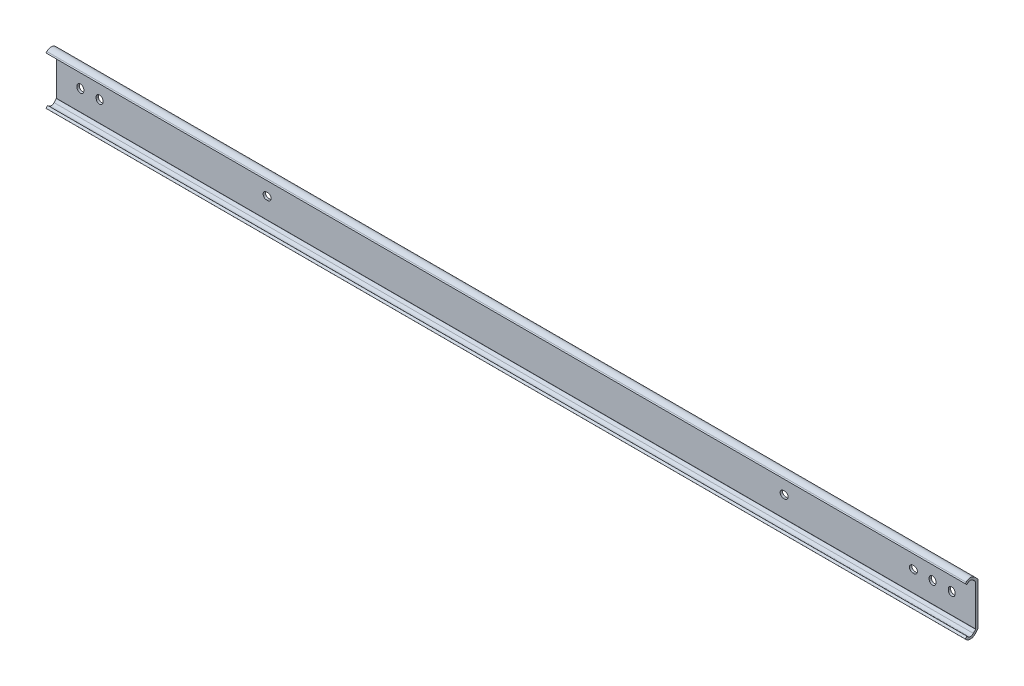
ISO-10303-21;
HEADER;
FILE_DESCRIPTION(('STEP AP214'),'2;1');
FILE_NAME('part.step','',(''),(''),'','','');
FILE_SCHEMA(('AUTOMOTIVE_DESIGN { 1 0 10303 214 1 1 1 1 }'));
ENDSEC;
DATA;
#1=APPLICATION_CONTEXT('core data for automotive mechanical design processes');
#2=APPLICATION_PROTOCOL_DEFINITION('international standard','automotive_design',2000,#1);
#3=PRODUCT_CONTEXT('',#1,'mechanical');
#4=PRODUCT('Part','Part','',(#3));
#5=PRODUCT_RELATED_PRODUCT_CATEGORY('part','',(#4));
#6=PRODUCT_DEFINITION_FORMATION('','',#4);
#7=PRODUCT_DEFINITION_CONTEXT('part definition',#1,'design');
#8=PRODUCT_DEFINITION('design','',#6,#7);
#9=PRODUCT_DEFINITION_SHAPE('','',#8);
#10=(LENGTH_UNIT() NAMED_UNIT(*) SI_UNIT(.MILLI.,.METRE.));
#11=(NAMED_UNIT(*) PLANE_ANGLE_UNIT() SI_UNIT($,.RADIAN.));
#12=(NAMED_UNIT(*) SI_UNIT($,.STERADIAN.) SOLID_ANGLE_UNIT());
#13=UNCERTAINTY_MEASURE_WITH_UNIT(LENGTH_MEASURE(1.E-05),#10,'distance_accuracy_value','');
#14=(GEOMETRIC_REPRESENTATION_CONTEXT(3) GLOBAL_UNCERTAINTY_ASSIGNED_CONTEXT((#13)) GLOBAL_UNIT_ASSIGNED_CONTEXT((#10,
#11,#12)) REPRESENTATION_CONTEXT('',''));
#15=CARTESIAN_POINT('',(0.,0.,0.));
#16=DIRECTION('',(0.,0.,1.));
#17=DIRECTION('',(1.,0.,0.));
#18=AXIS2_PLACEMENT_3D('',#15,#16,#17);
#19=CARTESIAN_POINT('',(-15.9,-13.5610180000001,0.));
#20=DIRECTION('',(0.,0.,-1.));
#21=DIRECTION('',(1.,0.,0.));
#22=AXIS2_PLACEMENT_3D('',#19,#20,#21);
#23=PLANE('',#22);
#24=DIRECTION('',(1.,0.,0.));
#25=VECTOR('',#24,1.);
#26=CARTESIAN_POINT('',(-15.9,13.561018,0.));
#27=LINE('',#26,#25);
#28=CARTESIAN_POINT('',(-15.9,13.561018,0.));
#29=VERTEX_POINT('',#28);
#30=CARTESIAN_POINT('',(593.7,13.561018,0.));
#31=VERTEX_POINT('',#30);
#32=EDGE_CURVE('E667',#29,#31,#27,.T.);
#33=ORIENTED_EDGE('',*,*,#32,.T.);
#34=DIRECTION('',(0.,1.,0.));
#35=VECTOR('',#34,1.);
#36=CARTESIAN_POINT('',(593.7,-13.5610180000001,0.));
#37=LINE('',#36,#35);
#38=CARTESIAN_POINT('',(593.7,-13.5610180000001,0.));
#39=VERTEX_POINT('',#38);
#40=EDGE_CURVE('E601',#39,#31,#37,.T.);
#41=ORIENTED_EDGE('',*,*,#40,.F.);
#42=DIRECTION('',(1.,0.,0.));
#43=VECTOR('',#42,1.);
#44=CARTESIAN_POINT('',(-15.9,-13.5610180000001,0.));
#45=LINE('',#44,#43);
#46=CARTESIAN_POINT('',(-15.9,-13.5610180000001,0.));
#47=VERTEX_POINT('',#46);
#48=EDGE_CURVE('E670',#47,#39,#45,.T.);
#49=ORIENTED_EDGE('',*,*,#48,.F.);
#50=DIRECTION('',(0.,1.,0.));
#51=VECTOR('',#50,1.);
#52=CARTESIAN_POINT('',(-15.9,-13.5610180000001,0.));
#53=LINE('',#52,#51);
#54=EDGE_CURVE('E658',#47,#29,#53,.T.);
#55=ORIENTED_EDGE('',*,*,#54,.T.);
#56=EDGE_LOOP('',(#33,#41,#49,#55));
#57=FACE_BOUND('',#56,.T.);
#58=CARTESIAN_POINT('',(467.1,0.,0.));
#59=DIRECTION('',(0.,0.,-1.));
#60=DIRECTION('',(1.,0.,0.));
#61=AXIS2_PLACEMENT_3D('',#58,#59,#60);
#62=CIRCLE('',#61,2.25);
#63=CARTESIAN_POINT('',(467.1,2.24999999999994,0.));
#64=VERTEX_POINT('',#63);
#65=CARTESIAN_POINT('',(467.1,-2.25000000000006,0.));
#66=VERTEX_POINT('',#65);
#67=EDGE_CURVE('E362',#64,#66,#62,.T.);
#68=ORIENTED_EDGE('',*,*,#67,.F.);
#69=DIRECTION('',(1.,0.,0.));
#70=VECTOR('',#69,1.);
#71=CARTESIAN_POINT('',(-15.9,2.24999999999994,0.));
#72=LINE('',#71,#70);
#73=CARTESIAN_POINT('',(466.3,2.24999999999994,0.));
#74=VERTEX_POINT('',#73);
#75=EDGE_CURVE('E329',#74,#64,#72,.T.);
#76=ORIENTED_EDGE('',*,*,#75,.F.);
#77=CARTESIAN_POINT('',(466.3,0.,0.));
#78=DIRECTION('',(0.,0.,-1.));
#79=DIRECTION('',(1.,0.,0.));
#80=AXIS2_PLACEMENT_3D('',#77,#78,#79);
#81=CIRCLE('',#80,2.25);
#82=CARTESIAN_POINT('',(466.3,-2.25000000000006,0.));
#83=VERTEX_POINT('',#82);
#84=EDGE_CURVE('E360',#83,#74,#81,.T.);
#85=ORIENTED_EDGE('',*,*,#84,.F.);
#86=DIRECTION('',(-1.,0.,0.));
#87=VECTOR('',#86,1.);
#88=CARTESIAN_POINT('',(-15.9,-2.25000000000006,0.));
#89=LINE('',#88,#87);
#90=EDGE_CURVE('E358',#66,#83,#89,.T.);
#91=ORIENTED_EDGE('',*,*,#90,.F.);
#92=EDGE_LOOP('',(#68,#76,#85,#91));
#93=FACE_BOUND('',#92,.T.);
#94=CARTESIAN_POINT('',(0.,0.400000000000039,0.));
#95=DIRECTION('',(0.,0.,-1.));
#96=DIRECTION('',(1.,0.,0.));
#97=AXIS2_PLACEMENT_3D('',#94,#95,#96);
#98=CIRCLE('',#97,2.25000000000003);
#99=CARTESIAN_POINT('',(2.24999999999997,0.400000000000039,0.));
#100=VERTEX_POINT('',#99);
#101=CARTESIAN_POINT('',(-2.24999999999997,0.400000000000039,0.));
#102=VERTEX_POINT('',#101);
#103=EDGE_CURVE('E370',#100,#102,#98,.F.);
#104=ORIENTED_EDGE('',*,*,#103,.T.);
#105=DIRECTION('',(0.,-1.,0.));
#106=VECTOR('',#105,1.);
#107=CARTESIAN_POINT('',(-2.24999999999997,0.400000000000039,0.));
#108=LINE('',#107,#106);
#109=CARTESIAN_POINT('',(-2.24999999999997,-0.400000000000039,0.));
#110=VERTEX_POINT('',#109);
#111=EDGE_CURVE('E385',#102,#110,#108,.T.);
#112=ORIENTED_EDGE('',*,*,#111,.T.);
#113=CARTESIAN_POINT('',(0.,-0.400000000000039,0.));
#114=DIRECTION('',(0.,0.,-1.));
#115=DIRECTION('',(1.,0.,0.));
#116=AXIS2_PLACEMENT_3D('',#113,#114,#115);
#117=CIRCLE('',#116,2.25000000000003);
#118=CARTESIAN_POINT('',(2.24999999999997,-0.400000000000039,0.));
#119=VERTEX_POINT('',#118);
#120=EDGE_CURVE('E364',#110,#119,#117,.F.);
#121=ORIENTED_EDGE('',*,*,#120,.T.);
#122=DIRECTION('',(0.,1.,0.));
#123=VECTOR('',#122,1.);
#124=CARTESIAN_POINT('',(2.24999999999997,-0.400000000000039,0.));
#125=LINE('',#124,#123);
#126=EDGE_CURVE('E367',#119,#100,#125,.T.);
#127=ORIENTED_EDGE('',*,*,#126,.T.);
#128=EDGE_LOOP('',(#104,#112,#121,#127));
#129=FACE_BOUND('',#128,.T.);
#130=CARTESIAN_POINT('',(565.1,0.400000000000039,0.));
#131=DIRECTION('',(0.,0.,1.));
#132=DIRECTION('',(1.,0.,0.));
#133=AXIS2_PLACEMENT_3D('',#130,#131,#132);
#134=CIRCLE('',#133,2.24999999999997);
#135=CARTESIAN_POINT('',(567.35,0.400000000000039,0.));
#136=VERTEX_POINT('',#135);
#137=CARTESIAN_POINT('',(562.85,0.400000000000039,0.));
#138=VERTEX_POINT('',#137);
#139=EDGE_CURVE('E531',#136,#138,#134,.T.);
#140=ORIENTED_EDGE('',*,*,#139,.T.);
#141=DIRECTION('',(0.,-1.,0.));
#142=VECTOR('',#141,1.);
#143=CARTESIAN_POINT('',(562.85,0.400000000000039,0.));
#144=LINE('',#143,#142);
#145=CARTESIAN_POINT('',(562.85,-0.400000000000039,0.));
#146=VERTEX_POINT('',#145);
#147=EDGE_CURVE('E534',#138,#146,#144,.T.);
#148=ORIENTED_EDGE('',*,*,#147,.T.);
#149=CARTESIAN_POINT('',(565.1,-0.400000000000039,0.));
#150=DIRECTION('',(0.,0.,1.));
#151=DIRECTION('',(1.,0.,0.));
#152=AXIS2_PLACEMENT_3D('',#149,#150,#151);
#153=CIRCLE('',#152,2.24999999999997);
#154=CARTESIAN_POINT('',(567.35,-0.400000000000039,0.));
#155=VERTEX_POINT('',#154);
#156=EDGE_CURVE('E537',#146,#155,#153,.T.);
#157=ORIENTED_EDGE('',*,*,#156,.T.);
#158=DIRECTION('',(0.,1.,0.));
#159=VECTOR('',#158,1.);
#160=CARTESIAN_POINT('',(567.35,0.400000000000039,0.));
#161=LINE('',#160,#159);
#162=EDGE_CURVE('E540',#155,#136,#161,.T.);
#163=ORIENTED_EDGE('',*,*,#162,.T.);
#164=EDGE_LOOP('',(#140,#148,#157,#163));
#165=FACE_BOUND('',#164,.T.);
#166=CARTESIAN_POINT('',(577.8,0.400000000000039,0.));
#167=DIRECTION('',(0.,0.,1.));
#168=DIRECTION('',(1.,0.,0.));
#169=AXIS2_PLACEMENT_3D('',#166,#167,#168);
#170=CIRCLE('',#169,2.24999999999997);
#171=CARTESIAN_POINT('',(580.05,0.400000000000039,0.));
#172=VERTEX_POINT('',#171);
#173=CARTESIAN_POINT('',(575.55,0.400000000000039,0.));
#174=VERTEX_POINT('',#173);
#175=EDGE_CURVE('E499',#172,#174,#170,.T.);
#176=ORIENTED_EDGE('',*,*,#175,.T.);
#177=DIRECTION('',(0.,-1.,0.));
#178=VECTOR('',#177,1.);
#179=CARTESIAN_POINT('',(575.55,0.400000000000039,0.));
#180=LINE('',#179,#178);
#181=CARTESIAN_POINT('',(575.55,-0.400000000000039,0.));
#182=VERTEX_POINT('',#181);
#183=EDGE_CURVE('E502',#174,#182,#180,.T.);
#184=ORIENTED_EDGE('',*,*,#183,.T.);
#185=CARTESIAN_POINT('',(577.8,-0.400000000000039,0.));
#186=DIRECTION('',(0.,0.,1.));
#187=DIRECTION('',(1.,0.,0.));
#188=AXIS2_PLACEMENT_3D('',#185,#186,#187);
#189=CIRCLE('',#188,2.24999999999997);
#190=CARTESIAN_POINT('',(580.05,-0.400000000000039,0.));
#191=VERTEX_POINT('',#190);
#192=EDGE_CURVE('E505',#182,#191,#189,.T.);
#193=ORIENTED_EDGE('',*,*,#192,.T.);
#194=DIRECTION('',(0.,1.,0.));
#195=VECTOR('',#194,1.);
#196=CARTESIAN_POINT('',(580.05,0.400000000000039,0.));
#197=LINE('',#196,#195);
#198=EDGE_CURVE('E508',#191,#172,#197,.T.);
#199=ORIENTED_EDGE('',*,*,#198,.T.);
#200=EDGE_LOOP('',(#176,#184,#193,#199));
#201=FACE_BOUND('',#200,.T.);
#202=CARTESIAN_POINT('',(552.8,0.,0.));
#203=DIRECTION('',(0.,0.,1.));
#204=DIRECTION('',(1.,0.,0.));
#205=AXIS2_PLACEMENT_3D('',#202,#203,#204);
#206=CIRCLE('',#205,2.25);
#207=CARTESIAN_POINT('',(552.8,-2.25,0.));
#208=VERTEX_POINT('',#207);
#209=CARTESIAN_POINT('',(552.8,2.25,0.));
#210=VERTEX_POINT('',#209);
#211=EDGE_CURVE('E467',#208,#210,#206,.T.);
#212=ORIENTED_EDGE('',*,*,#211,.T.);
#213=DIRECTION('',(-1.,0.,0.));
#214=VECTOR('',#213,1.);
#215=CARTESIAN_POINT('',(552.8,2.25,0.));
#216=LINE('',#215,#214);
#217=CARTESIAN_POINT('',(552.,2.25,0.));
#218=VERTEX_POINT('',#217);
#219=EDGE_CURVE('E470',#210,#218,#216,.T.);
#220=ORIENTED_EDGE('',*,*,#219,.T.);
#221=CARTESIAN_POINT('',(552.,0.,0.));
#222=DIRECTION('',(0.,0.,1.));
#223=DIRECTION('',(1.,0.,0.));
#224=AXIS2_PLACEMENT_3D('',#221,#222,#223);
#225=CIRCLE('',#224,2.25);
#226=CARTESIAN_POINT('',(552.,-2.25,0.));
#227=VERTEX_POINT('',#226);
#228=EDGE_CURVE('E473',#218,#227,#225,.T.);
#229=ORIENTED_EDGE('',*,*,#228,.T.);
#230=DIRECTION('',(1.,0.,0.));
#231=VECTOR('',#230,1.);
#232=CARTESIAN_POINT('',(552.8,-2.25,0.));
#233=LINE('',#232,#231);
#234=EDGE_CURVE('E476',#227,#208,#233,.T.);
#235=ORIENTED_EDGE('',*,*,#234,.T.);
#236=EDGE_LOOP('',(#212,#220,#229,#235));
#237=FACE_BOUND('',#236,.T.);
#238=CARTESIAN_POINT('',(12.7,0.400000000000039,0.));
#239=DIRECTION('',(0.,0.,1.));
#240=DIRECTION('',(1.,0.,0.));
#241=AXIS2_PLACEMENT_3D('',#238,#239,#240);
#242=CIRCLE('',#241,2.24999999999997);
#243=CARTESIAN_POINT('',(14.95,0.400000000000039,0.));
#244=VERTEX_POINT('',#243);
#245=CARTESIAN_POINT('',(10.45,0.400000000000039,0.));
#246=VERTEX_POINT('',#245);
#247=EDGE_CURVE('E435',#244,#246,#242,.T.);
#248=ORIENTED_EDGE('',*,*,#247,.T.);
#249=DIRECTION('',(0.,-1.,0.));
#250=VECTOR('',#249,1.);
#251=CARTESIAN_POINT('',(10.45,0.400000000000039,0.));
#252=LINE('',#251,#250);
#253=CARTESIAN_POINT('',(10.45,-0.400000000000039,0.));
#254=VERTEX_POINT('',#253);
#255=EDGE_CURVE('E438',#246,#254,#252,.T.);
#256=ORIENTED_EDGE('',*,*,#255,.T.);
#257=CARTESIAN_POINT('',(12.7,-0.400000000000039,0.));
#258=DIRECTION('',(0.,0.,1.));
#259=DIRECTION('',(1.,0.,0.));
#260=AXIS2_PLACEMENT_3D('',#257,#258,#259);
#261=CIRCLE('',#260,2.24999999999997);
#262=CARTESIAN_POINT('',(14.95,-0.400000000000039,0.));
#263=VERTEX_POINT('',#262);
#264=EDGE_CURVE('E441',#254,#263,#261,.T.);
#265=ORIENTED_EDGE('',*,*,#264,.T.);
#266=DIRECTION('',(0.,1.,0.));
#267=VECTOR('',#266,1.);
#268=CARTESIAN_POINT('',(14.95,0.400000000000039,0.));
#269=LINE('',#268,#267);
#270=EDGE_CURVE('E444',#263,#244,#269,.T.);
#271=ORIENTED_EDGE('',*,*,#270,.T.);
#272=EDGE_LOOP('',(#248,#256,#265,#271));
#273=FACE_BOUND('',#272,.T.);
#274=CARTESIAN_POINT('',(124.2,0.,0.));
#275=DIRECTION('',(0.,0.,1.));
#276=DIRECTION('',(1.,0.,0.));
#277=AXIS2_PLACEMENT_3D('',#274,#275,#276);
#278=CIRCLE('',#277,2.25);
#279=CARTESIAN_POINT('',(124.2,-2.24999999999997,0.));
#280=VERTEX_POINT('',#279);
#281=CARTESIAN_POINT('',(124.2,2.25000000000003,0.));
#282=VERTEX_POINT('',#281);
#283=EDGE_CURVE('E403',#280,#282,#278,.T.);
#284=ORIENTED_EDGE('',*,*,#283,.T.);
#285=DIRECTION('',(-1.,0.,0.));
#286=VECTOR('',#285,1.);
#287=CARTESIAN_POINT('',(124.2,2.25000000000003,0.));
#288=LINE('',#287,#286);
#289=CARTESIAN_POINT('',(123.4,2.25000000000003,0.));
#290=VERTEX_POINT('',#289);
#291=EDGE_CURVE('E406',#282,#290,#288,.T.);
#292=ORIENTED_EDGE('',*,*,#291,.T.);
#293=CARTESIAN_POINT('',(123.4,0.,0.));
#294=DIRECTION('',(0.,0.,1.));
#295=DIRECTION('',(1.,0.,0.));
#296=AXIS2_PLACEMENT_3D('',#293,#294,#295);
#297=CIRCLE('',#296,2.25);
#298=CARTESIAN_POINT('',(123.4,-2.24999999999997,0.));
#299=VERTEX_POINT('',#298);
#300=EDGE_CURVE('E409',#290,#299,#297,.T.);
#301=ORIENTED_EDGE('',*,*,#300,.T.);
#302=DIRECTION('',(1.,0.,0.));
#303=VECTOR('',#302,1.);
#304=CARTESIAN_POINT('',(124.2,-2.24999999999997,0.));
#305=LINE('',#304,#303);
#306=EDGE_CURVE('E412',#299,#280,#305,.T.);
#307=ORIENTED_EDGE('',*,*,#306,.T.);
#308=EDGE_LOOP('',(#284,#292,#301,#307));
#309=FACE_BOUND('',#308,.T.);
#310=ADVANCED_FACE('F14',(#57,#93,#129,#165,#201,#237,#273,#309),#23,.T.);
#311=CARTESIAN_POINT('',(-15.9,13.561018,1.54999999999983));
#312=DIRECTION('',(0.,0.,1.));
#313=DIRECTION('',(-1.,0.,0.));
#314=AXIS2_PLACEMENT_3D('',#311,#312,#313);
#315=PLANE('',#314);
#316=DIRECTION('',(1.,0.,0.));
#317=VECTOR('',#316,1.);
#318=CARTESIAN_POINT('',(-15.9,-13.5610180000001,1.54999999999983));
#319=LINE('',#318,#317);
#320=CARTESIAN_POINT('',(-15.9,-13.5610180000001,1.54999999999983));
#321=VERTEX_POINT('',#320);
#322=CARTESIAN_POINT('',(593.7,-13.5610180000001,1.54999999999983));
#323=VERTEX_POINT('',#322);
#324=EDGE_CURVE('E689',#321,#323,#319,.T.);
#325=ORIENTED_EDGE('',*,*,#324,.T.);
#326=DIRECTION('',(0.,-1.,0.));
#327=VECTOR('',#326,1.);
#328=CARTESIAN_POINT('',(593.7,13.561018,1.54999999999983));
#329=LINE('',#328,#327);
#330=CARTESIAN_POINT('',(593.7,13.561018,1.54999999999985));
#331=VERTEX_POINT('',#330);
#332=EDGE_CURVE('E573',#331,#323,#329,.T.);
#333=ORIENTED_EDGE('',*,*,#332,.F.);
#334=DIRECTION('',(1.,0.,0.));
#335=VECTOR('',#334,1.);
#336=CARTESIAN_POINT('',(-15.9,13.561018,1.54999999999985));
#337=LINE('',#336,#335);
#338=CARTESIAN_POINT('',(-15.9,13.561018,1.54999999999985));
#339=VERTEX_POINT('',#338);
#340=EDGE_CURVE('E692',#339,#331,#337,.T.);
#341=ORIENTED_EDGE('',*,*,#340,.F.);
#342=DIRECTION('',(0.,-1.,0.));
#343=VECTOR('',#342,1.);
#344=CARTESIAN_POINT('',(-15.9,13.561018,1.54999999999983));
#345=LINE('',#344,#343);
#346=EDGE_CURVE('E629',#339,#321,#345,.T.);
#347=ORIENTED_EDGE('',*,*,#346,.T.);
#348=EDGE_LOOP('',(#325,#333,#341,#347));
#349=FACE_BOUND('',#348,.T.);
#350=DIRECTION('',(1.,0.,0.));
#351=VECTOR('',#350,1.);
#352=CARTESIAN_POINT('',(467.1,-2.25000000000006,1.54999999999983));
#353=LINE('',#352,#351);
#354=CARTESIAN_POINT('',(466.3,-2.25000000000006,1.54999999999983));
#355=VERTEX_POINT('',#354);
#356=CARTESIAN_POINT('',(467.1,-2.25000000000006,1.54999999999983));
#357=VERTEX_POINT('',#356);
#358=EDGE_CURVE('E333',#355,#357,#353,.T.);
#359=ORIENTED_EDGE('',*,*,#358,.F.);
#360=CARTESIAN_POINT('',(466.3,0.,1.54999999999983));
#361=DIRECTION('',(0.,0.,1.));
#362=DIRECTION('',(-1.,0.,0.));
#363=AXIS2_PLACEMENT_3D('',#360,#361,#362);
#364=CIRCLE('',#363,2.25);
#365=CARTESIAN_POINT('',(466.3,2.24999999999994,1.54999999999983));
#366=VERTEX_POINT('',#365);
#367=EDGE_CURVE('E347',#366,#355,#364,.T.);
#368=ORIENTED_EDGE('',*,*,#367,.F.);
#369=DIRECTION('',(-1.,0.,0.));
#370=VECTOR('',#369,1.);
#371=CARTESIAN_POINT('',(467.1,2.24999999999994,1.54999999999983));
#372=LINE('',#371,#370);
#373=CARTESIAN_POINT('',(467.1,2.24999999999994,1.54999999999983));
#374=VERTEX_POINT('',#373);
#375=EDGE_CURVE('E326',#374,#366,#372,.T.);
#376=ORIENTED_EDGE('',*,*,#375,.F.);
#377=CARTESIAN_POINT('',(467.1,0.,1.54999999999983));
#378=DIRECTION('',(0.,0.,1.));
#379=DIRECTION('',(-1.,0.,0.));
#380=AXIS2_PLACEMENT_3D('',#377,#378,#379);
#381=CIRCLE('',#380,2.25);
#382=EDGE_CURVE('E336',#357,#374,#381,.T.);
#383=ORIENTED_EDGE('',*,*,#382,.F.);
#384=EDGE_LOOP('',(#359,#368,#376,#383));
#385=FACE_BOUND('',#384,.T.);
#386=CARTESIAN_POINT('',(0.,0.400000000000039,1.54999999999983));
#387=DIRECTION('',(0.,0.,1.));
#388=DIRECTION('',(-1.,0.,0.));
#389=AXIS2_PLACEMENT_3D('',#386,#387,#388);
#390=CIRCLE('',#389,2.25000000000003);
#391=CARTESIAN_POINT('',(2.24999999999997,0.400000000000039,1.54999999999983));
#392=VERTEX_POINT('',#391);
#393=CARTESIAN_POINT('',(-2.24999999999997,0.400000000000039,1.54999999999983));
#394=VERTEX_POINT('',#393);
#395=EDGE_CURVE('E39',#392,#394,#390,.T.);
#396=ORIENTED_EDGE('',*,*,#395,.F.);
#397=DIRECTION('',(0.,1.,0.));
#398=VECTOR('',#397,1.);
#399=CARTESIAN_POINT('',(2.24999999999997,-0.400000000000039,1.54999999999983));
#400=LINE('',#399,#398);
#401=CARTESIAN_POINT('',(2.24999999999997,-0.400000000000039,1.54999999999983));
#402=VERTEX_POINT('',#401);
#403=EDGE_CURVE('E379',#402,#392,#400,.T.);
#404=ORIENTED_EDGE('',*,*,#403,.F.);
#405=CARTESIAN_POINT('',(0.,-0.400000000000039,1.54999999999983));
#406=DIRECTION('',(0.,0.,1.));
#407=DIRECTION('',(-1.,0.,0.));
#408=AXIS2_PLACEMENT_3D('',#405,#406,#407);
#409=CIRCLE('',#408,2.25000000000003);
#410=CARTESIAN_POINT('',(-2.24999999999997,-0.40000000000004,1.54999999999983));
#411=VERTEX_POINT('',#410);
#412=EDGE_CURVE('E376',#411,#402,#409,.T.);
#413=ORIENTED_EDGE('',*,*,#412,.F.);
#414=DIRECTION('',(0.,-1.,0.));
#415=VECTOR('',#414,1.);
#416=CARTESIAN_POINT('',(-2.24999999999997,0.400000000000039,1.54999999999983));
#417=LINE('',#416,#415);
#418=EDGE_CURVE('E374',#394,#411,#417,.T.);
#419=ORIENTED_EDGE('',*,*,#418,.F.);
#420=EDGE_LOOP('',(#396,#404,#413,#419));
#421=FACE_BOUND('',#420,.T.);
#422=CARTESIAN_POINT('',(565.1,0.400000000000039,1.54999999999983));
#423=DIRECTION('',(0.,0.,1.));
#424=DIRECTION('',(1.,0.,0.));
#425=AXIS2_PLACEMENT_3D('',#422,#423,#424);
#426=CIRCLE('',#425,2.24999999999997);
#427=CARTESIAN_POINT('',(567.35,0.400000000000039,1.54999999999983));
#428=VERTEX_POINT('',#427);
#429=CARTESIAN_POINT('',(562.85,0.400000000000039,1.54999999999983));
#430=VERTEX_POINT('',#429);
#431=EDGE_CURVE('E514',#428,#430,#426,.T.);
#432=ORIENTED_EDGE('',*,*,#431,.F.);
#433=DIRECTION('',(0.,1.,0.));
#434=VECTOR('',#433,1.);
#435=CARTESIAN_POINT('',(567.35,0.400000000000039,1.54999999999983));
#436=LINE('',#435,#434);
#437=CARTESIAN_POINT('',(567.35,-0.400000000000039,1.54999999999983));
#438=VERTEX_POINT('',#437);
#439=EDGE_CURVE('E528',#438,#428,#436,.T.);
#440=ORIENTED_EDGE('',*,*,#439,.F.);
#441=CARTESIAN_POINT('',(565.1,-0.400000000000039,1.54999999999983));
#442=DIRECTION('',(0.,0.,1.));
#443=DIRECTION('',(1.,0.,0.));
#444=AXIS2_PLACEMENT_3D('',#441,#442,#443);
#445=CIRCLE('',#444,2.24999999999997);
#446=CARTESIAN_POINT('',(562.85,-0.40000000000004,1.54999999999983));
#447=VERTEX_POINT('',#446);
#448=EDGE_CURVE('E525',#447,#438,#445,.T.);
#449=ORIENTED_EDGE('',*,*,#448,.F.);
#450=DIRECTION('',(0.,-1.,0.));
#451=VECTOR('',#450,1.);
#452=CARTESIAN_POINT('',(562.85,0.400000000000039,1.54999999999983));
#453=LINE('',#452,#451);
#454=EDGE_CURVE('E522',#430,#447,#453,.T.);
#455=ORIENTED_EDGE('',*,*,#454,.F.);
#456=EDGE_LOOP('',(#432,#440,#449,#455));
#457=FACE_BOUND('',#456,.T.);
#458=CARTESIAN_POINT('',(577.8,0.400000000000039,1.54999999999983));
#459=DIRECTION('',(0.,0.,1.));
#460=DIRECTION('',(1.,0.,0.));
#461=AXIS2_PLACEMENT_3D('',#458,#459,#460);
#462=CIRCLE('',#461,2.24999999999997);
#463=CARTESIAN_POINT('',(580.05,0.400000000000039,1.54999999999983));
#464=VERTEX_POINT('',#463);
#465=CARTESIAN_POINT('',(575.55,0.400000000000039,1.54999999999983));
#466=VERTEX_POINT('',#465);
#467=EDGE_CURVE('E482',#464,#466,#462,.T.);
#468=ORIENTED_EDGE('',*,*,#467,.F.);
#469=DIRECTION('',(0.,1.,0.));
#470=VECTOR('',#469,1.);
#471=CARTESIAN_POINT('',(580.05,0.400000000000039,1.54999999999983));
#472=LINE('',#471,#470);
#473=CARTESIAN_POINT('',(580.05,-0.400000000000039,1.54999999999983));
#474=VERTEX_POINT('',#473);
#475=EDGE_CURVE('E496',#474,#464,#472,.T.);
#476=ORIENTED_EDGE('',*,*,#475,.F.);
#477=CARTESIAN_POINT('',(577.8,-0.400000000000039,1.54999999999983));
#478=DIRECTION('',(0.,0.,1.));
#479=DIRECTION('',(1.,0.,0.));
#480=AXIS2_PLACEMENT_3D('',#477,#478,#479);
#481=CIRCLE('',#480,2.24999999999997);
#482=CARTESIAN_POINT('',(575.55,-0.40000000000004,1.54999999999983));
#483=VERTEX_POINT('',#482);
#484=EDGE_CURVE('E493',#483,#474,#481,.T.);
#485=ORIENTED_EDGE('',*,*,#484,.F.);
#486=DIRECTION('',(0.,-1.,0.));
#487=VECTOR('',#486,1.);
#488=CARTESIAN_POINT('',(575.55,0.400000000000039,1.54999999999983));
#489=LINE('',#488,#487);
#490=EDGE_CURVE('E490',#466,#483,#489,.T.);
#491=ORIENTED_EDGE('',*,*,#490,.F.);
#492=EDGE_LOOP('',(#468,#476,#485,#491));
#493=FACE_BOUND('',#492,.T.);
#494=CARTESIAN_POINT('',(552.8,0.,1.54999999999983));
#495=DIRECTION('',(0.,0.,1.));
#496=DIRECTION('',(1.,0.,0.));
#497=AXIS2_PLACEMENT_3D('',#494,#495,#496);
#498=CIRCLE('',#497,2.25);
#499=CARTESIAN_POINT('',(552.8,-2.25,1.54999999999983));
#500=VERTEX_POINT('',#499);
#501=CARTESIAN_POINT('',(552.8,2.25,1.54999999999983));
#502=VERTEX_POINT('',#501);
#503=EDGE_CURVE('E450',#500,#502,#498,.T.);
#504=ORIENTED_EDGE('',*,*,#503,.F.);
#505=DIRECTION('',(1.,0.,0.));
#506=VECTOR('',#505,1.);
#507=CARTESIAN_POINT('',(552.8,-2.25,1.54999999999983));
#508=LINE('',#507,#506);
#509=CARTESIAN_POINT('',(552.,-2.25,1.54999999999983));
#510=VERTEX_POINT('',#509);
#511=EDGE_CURVE('E464',#510,#500,#508,.T.);
#512=ORIENTED_EDGE('',*,*,#511,.F.);
#513=CARTESIAN_POINT('',(552.,0.,1.54999999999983));
#514=DIRECTION('',(0.,0.,1.));
#515=DIRECTION('',(1.,0.,0.));
#516=AXIS2_PLACEMENT_3D('',#513,#514,#515);
#517=CIRCLE('',#516,2.25);
#518=CARTESIAN_POINT('',(552.,2.25,1.54999999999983));
#519=VERTEX_POINT('',#518);
#520=EDGE_CURVE('E461',#519,#510,#517,.T.);
#521=ORIENTED_EDGE('',*,*,#520,.F.);
#522=DIRECTION('',(-1.,0.,0.));
#523=VECTOR('',#522,1.);
#524=CARTESIAN_POINT('',(552.8,2.25,1.54999999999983));
#525=LINE('',#524,#523);
#526=EDGE_CURVE('E458',#502,#519,#525,.T.);
#527=ORIENTED_EDGE('',*,*,#526,.F.);
#528=EDGE_LOOP('',(#504,#512,#521,#527));
#529=FACE_BOUND('',#528,.T.);
#530=CARTESIAN_POINT('',(12.7,0.400000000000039,1.54999999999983));
#531=DIRECTION('',(0.,0.,1.));
#532=DIRECTION('',(1.,0.,0.));
#533=AXIS2_PLACEMENT_3D('',#530,#531,#532);
#534=CIRCLE('',#533,2.24999999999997);
#535=CARTESIAN_POINT('',(14.95,0.400000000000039,1.54999999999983));
#536=VERTEX_POINT('',#535);
#537=CARTESIAN_POINT('',(10.45,0.400000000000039,1.54999999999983));
#538=VERTEX_POINT('',#537);
#539=EDGE_CURVE('E418',#536,#538,#534,.T.);
#540=ORIENTED_EDGE('',*,*,#539,.F.);
#541=DIRECTION('',(0.,1.,0.));
#542=VECTOR('',#541,1.);
#543=CARTESIAN_POINT('',(14.95,0.400000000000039,1.54999999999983));
#544=LINE('',#543,#542);
#545=CARTESIAN_POINT('',(14.95,-0.400000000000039,1.54999999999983));
#546=VERTEX_POINT('',#545);
#547=EDGE_CURVE('E432',#546,#536,#544,.T.);
#548=ORIENTED_EDGE('',*,*,#547,.F.);
#549=CARTESIAN_POINT('',(12.7,-0.400000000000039,1.54999999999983));
#550=DIRECTION('',(0.,0.,1.));
#551=DIRECTION('',(1.,0.,0.));
#552=AXIS2_PLACEMENT_3D('',#549,#550,#551);
#553=CIRCLE('',#552,2.24999999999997);
#554=CARTESIAN_POINT('',(10.45,-0.40000000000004,1.54999999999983));
#555=VERTEX_POINT('',#554);
#556=EDGE_CURVE('E429',#555,#546,#553,.T.);
#557=ORIENTED_EDGE('',*,*,#556,.F.);
#558=DIRECTION('',(0.,-1.,0.));
#559=VECTOR('',#558,1.);
#560=CARTESIAN_POINT('',(10.45,0.400000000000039,1.54999999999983));
#561=LINE('',#560,#559);
#562=EDGE_CURVE('E426',#538,#555,#561,.T.);
#563=ORIENTED_EDGE('',*,*,#562,.F.);
#564=EDGE_LOOP('',(#540,#548,#557,#563));
#565=FACE_BOUND('',#564,.T.);
#566=CARTESIAN_POINT('',(124.2,0.,1.54999999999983));
#567=DIRECTION('',(0.,0.,1.));
#568=DIRECTION('',(1.,0.,0.));
#569=AXIS2_PLACEMENT_3D('',#566,#567,#568);
#570=CIRCLE('',#569,2.25);
#571=CARTESIAN_POINT('',(124.2,-2.24999999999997,1.54999999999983));
#572=VERTEX_POINT('',#571);
#573=CARTESIAN_POINT('',(124.2,2.25000000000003,1.54999999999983));
#574=VERTEX_POINT('',#573);
#575=EDGE_CURVE('E392',#572,#574,#570,.T.);
#576=ORIENTED_EDGE('',*,*,#575,.F.);
#577=DIRECTION('',(1.,0.,0.));
#578=VECTOR('',#577,1.);
#579=CARTESIAN_POINT('',(124.2,-2.24999999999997,1.54999999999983));
#580=LINE('',#579,#578);
#581=CARTESIAN_POINT('',(123.4,-2.24999999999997,1.54999999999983));
#582=VERTEX_POINT('',#581);
#583=EDGE_CURVE('E400',#582,#572,#580,.T.);
#584=ORIENTED_EDGE('',*,*,#583,.F.);
#585=CARTESIAN_POINT('',(123.4,0.,1.54999999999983));
#586=DIRECTION('',(0.,0.,1.));
#587=DIRECTION('',(1.,0.,0.));
#588=AXIS2_PLACEMENT_3D('',#585,#586,#587);
#589=CIRCLE('',#588,2.25);
#590=CARTESIAN_POINT('',(123.4,2.25000000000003,1.54999999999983));
#591=VERTEX_POINT('',#590);
#592=EDGE_CURVE('E397',#591,#582,#589,.T.);
#593=ORIENTED_EDGE('',*,*,#592,.F.);
#594=DIRECTION('',(-1.,0.,0.));
#595=VECTOR('',#594,1.);
#596=CARTESIAN_POINT('',(124.2,2.25000000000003,1.54999999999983));
#597=LINE('',#596,#595);
#598=EDGE_CURVE('E394',#574,#591,#597,.T.);
#599=ORIENTED_EDGE('',*,*,#598,.F.);
#600=EDGE_LOOP('',(#576,#584,#593,#599));
#601=FACE_BOUND('',#600,.T.);
#602=ADVANCED_FACE('F344',(#349,#385,#421,#457,#493,#529,#565,#601),#315,.T.);
#603=CARTESIAN_POINT('',(593.7,13.575,5.00000000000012));
#604=DIRECTION('',(-1.,0.,0.));
#605=DIRECTION('',(0.,0.,-1.));
#606=AXIS2_PLACEMENT_3D('',#603,#604,#605);
#607=PLANE('',#606);
#608=ORIENTED_EDGE('',*,*,#40,.T.);
#609=CARTESIAN_POINT('',(593.7,13.5610179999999,1.80000000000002));
#610=DIRECTION('',(1.,0.,0.));
#611=DIRECTION('',(0.,0.,-1.));
#612=AXIS2_PLACEMENT_3D('',#609,#610,#611);
#613=CIRCLE('',#612,1.8);
#614=CARTESIAN_POINT('',(593.7,14.8073560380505,0.501292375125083));
#615=VERTEX_POINT('',#614);
#616=EDGE_CURVE('E603',#31,#615,#613,.T.);
#617=ORIENTED_EDGE('',*,*,#616,.T.);
#618=DIRECTION('',(0.,0.721504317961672,0.692409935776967));
#619=VECTOR('',#618,1.);
#620=CARTESIAN_POINT('',(593.7,14.8073560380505,0.501292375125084));
#621=LINE('',#620,#619);
#622=CARTESIAN_POINT('',(593.7,16.4741282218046,2.10085261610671));
#623=VERTEX_POINT('',#622);
#624=EDGE_CURVE('E606',#615,#623,#621,.T.);
#625=ORIENTED_EDGE('',*,*,#624,.T.);
#626=CARTESIAN_POINT('',(593.7,13.575,5.00000000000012));
#627=DIRECTION('',(1.,0.,0.));
#628=DIRECTION('',(0.,0.,-1.));
#629=AXIS2_PLACEMENT_3D('',#626,#627,#628);
#630=CIRCLE('',#629,4.1);
#631=CARTESIAN_POINT('',(593.7,16.4741282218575,7.89914738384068));
#632=VERTEX_POINT('',#631);
#633=EDGE_CURVE('E546',#623,#632,#630,.T.);
#634=ORIENTED_EDGE('',*,*,#633,.T.);
#635=DIRECTION('',(0.,-0.721504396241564,0.692409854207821));
#636=VECTOR('',#635,1.);
#637=CARTESIAN_POINT('',(593.7,15.8897090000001,8.45999999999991));
#638=LINE('',#637,#636);
#639=CARTESIAN_POINT('',(593.7,15.8897090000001,8.45999999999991));
#640=VERTEX_POINT('',#639);
#641=EDGE_CURVE('E555',#632,#640,#638,.T.);
#642=ORIENTED_EDGE('',*,*,#641,.T.);
#643=DIRECTION('',(0.,-0.707106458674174,-0.707107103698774));
#644=VECTOR('',#643,1.);
#645=CARTESIAN_POINT('',(593.7,14.793462,7.363752));
#646=LINE('',#645,#644);
#647=CARTESIAN_POINT('',(593.7,14.793462,7.363752));
#648=VERTEX_POINT('',#647);
#649=EDGE_CURVE('E558',#640,#648,#646,.T.);
#650=ORIENTED_EDGE('',*,*,#649,.T.);
#651=DIRECTION('',(0.,0.721503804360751,-0.692410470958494));
#652=VECTOR('',#651,1.);
#653=CARTESIAN_POINT('',(593.7,15.3880487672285,6.79314086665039));
#654=LINE('',#653,#652);
#655=CARTESIAN_POINT('',(593.7,15.3880487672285,6.79314086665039));
#656=VERTEX_POINT('',#655);
#657=EDGE_CURVE('E561',#648,#656,#654,.T.);
#658=ORIENTED_EDGE('',*,*,#657,.T.);
#659=CARTESIAN_POINT('',(593.7,13.575,5.00000000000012));
#660=DIRECTION('',(-1.,0.,0.));
#661=DIRECTION('',(0.,0.,1.));
#662=AXIS2_PLACEMENT_3D('',#659,#660,#661);
#663=CIRCLE('',#662,2.55);
#664=CARTESIAN_POINT('',(593.7,15.2920682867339,3.11474762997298));
#665=VERTEX_POINT('',#664);
#666=EDGE_CURVE('E564',#656,#665,#663,.T.);
#667=ORIENTED_EDGE('',*,*,#666,.T.);
#668=DIRECTION('',(0.,-0.721504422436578,-0.692409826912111));
#669=VECTOR('',#668,1.);
#670=CARTESIAN_POINT('',(593.7,13.7341205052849,1.61962394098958));
#671=LINE('',#670,#669);
#672=CARTESIAN_POINT('',(593.7,13.7341205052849,1.61962394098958));
#673=VERTEX_POINT('',#672);
#674=EDGE_CURVE('E567',#665,#673,#671,.T.);
#675=ORIENTED_EDGE('',*,*,#674,.T.);
#676=CARTESIAN_POINT('',(593.7,13.5610179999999,1.80000000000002));
#677=DIRECTION('',(-1.,0.,0.));
#678=DIRECTION('',(0.,0.,1.));
#679=AXIS2_PLACEMENT_3D('',#676,#677,#678);
#680=CIRCLE('',#679,0.250000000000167);
#681=EDGE_CURVE('E570',#673,#331,#680,.T.);
#682=ORIENTED_EDGE('',*,*,#681,.T.);
#683=ORIENTED_EDGE('',*,*,#332,.T.);
#684=CARTESIAN_POINT('',(593.7,-13.561018,1.80000000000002));
#685=DIRECTION('',(-1.,0.,0.));
#686=DIRECTION('',(0.,0.,-1.));
#687=AXIS2_PLACEMENT_3D('',#684,#685,#686);
#688=CIRCLE('',#687,0.250000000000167);
#689=CARTESIAN_POINT('',(593.7,-13.734120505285,1.61962394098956));
#690=VERTEX_POINT('',#689);
#691=EDGE_CURVE('E575',#323,#690,#688,.T.);
#692=ORIENTED_EDGE('',*,*,#691,.T.);
#693=DIRECTION('',(0.,-0.721504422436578,0.692409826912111));
#694=VECTOR('',#693,1.);
#695=CARTESIAN_POINT('',(593.7,-13.734120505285,1.61962394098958));
#696=LINE('',#695,#694);
#697=CARTESIAN_POINT('',(593.7,-15.292068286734,3.11474762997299));
#698=VERTEX_POINT('',#697);
#699=EDGE_CURVE('E578',#690,#698,#696,.T.);
#700=ORIENTED_EDGE('',*,*,#699,.T.);
#701=CARTESIAN_POINT('',(593.7,-13.5750000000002,5.00000000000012));
#702=DIRECTION('',(-1.,0.,0.));
#703=DIRECTION('',(0.,0.,-1.));
#704=AXIS2_PLACEMENT_3D('',#701,#702,#703);
#705=CIRCLE('',#704,2.55);
#706=CARTESIAN_POINT('',(593.7,-15.3880487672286,6.79314086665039));
#707=VERTEX_POINT('',#706);
#708=EDGE_CURVE('E581',#698,#707,#705,.T.);
#709=ORIENTED_EDGE('',*,*,#708,.T.);
#710=DIRECTION('',(0.,0.721503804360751,0.692410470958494));
#711=VECTOR('',#710,1.);
#712=CARTESIAN_POINT('',(593.7,-15.3880487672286,6.79314086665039));
#713=LINE('',#712,#711);
#714=CARTESIAN_POINT('',(593.7,-14.7934620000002,7.363752));
#715=VERTEX_POINT('',#714);
#716=EDGE_CURVE('E584',#707,#715,#713,.T.);
#717=ORIENTED_EDGE('',*,*,#716,.T.);
#718=DIRECTION('',(0.,-0.707106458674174,0.707107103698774));
#719=VECTOR('',#718,1.);
#720=CARTESIAN_POINT('',(593.7,-14.7934620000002,7.363752));
#721=LINE('',#720,#719);
#722=CARTESIAN_POINT('',(593.7,-15.8897090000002,8.45999999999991));
#723=VERTEX_POINT('',#722);
#724=EDGE_CURVE('E587',#715,#723,#721,.T.);
#725=ORIENTED_EDGE('',*,*,#724,.T.);
#726=DIRECTION('',(0.,-0.721504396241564,-0.692409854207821));
#727=VECTOR('',#726,1.);
#728=CARTESIAN_POINT('',(593.7,-15.8897090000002,8.45999999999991));
#729=LINE('',#728,#727);
#730=CARTESIAN_POINT('',(593.7,-16.4741282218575,7.89914738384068));
#731=VERTEX_POINT('',#730);
#732=EDGE_CURVE('E590',#723,#731,#729,.T.);
#733=ORIENTED_EDGE('',*,*,#732,.T.);
#734=CARTESIAN_POINT('',(593.7,-13.5750000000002,5.00000000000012));
#735=DIRECTION('',(1.,0.,0.));
#736=DIRECTION('',(0.,0.,1.));
#737=AXIS2_PLACEMENT_3D('',#734,#735,#736);
#738=CIRCLE('',#737,4.1);
#739=CARTESIAN_POINT('',(593.7,-16.4741282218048,2.10085261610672));
#740=VERTEX_POINT('',#739);
#741=EDGE_CURVE('E593',#731,#740,#738,.T.);
#742=ORIENTED_EDGE('',*,*,#741,.T.);
#743=DIRECTION('',(0.,0.721504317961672,-0.692409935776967));
#744=VECTOR('',#743,1.);
#745=CARTESIAN_POINT('',(593.7,-14.8073560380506,0.501292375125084));
#746=LINE('',#745,#744);
#747=CARTESIAN_POINT('',(593.7,-14.8073560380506,0.501292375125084));
#748=VERTEX_POINT('',#747);
#749=EDGE_CURVE('E596',#740,#748,#746,.T.);
#750=ORIENTED_EDGE('',*,*,#749,.T.);
#751=CARTESIAN_POINT('',(593.7,-13.561018,1.80000000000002));
#752=DIRECTION('',(1.,0.,0.));
#753=DIRECTION('',(0.,0.,1.));
#754=AXIS2_PLACEMENT_3D('',#751,#752,#753);
#755=CIRCLE('',#754,1.8);
#756=EDGE_CURVE('E598',#748,#39,#755,.T.);
#757=ORIENTED_EDGE('',*,*,#756,.T.);
#758=EDGE_LOOP('',(#608,#617,#625,#634,#642,#650,#658,#667,#675,#682,#683,#692,#700,#709,#717,
#725,#733,#742,#750,#757));
#759=FACE_BOUND('',#758,.T.);
#760=ADVANCED_FACE('F712',(#759),#607,.F.);
#761=CARTESIAN_POINT('',(-15.9,13.575,5.00000000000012));
#762=DIRECTION('',(1.,0.,0.));
#763=DIRECTION('',(0.,0.,1.));
#764=AXIS2_PLACEMENT_3D('',#761,#762,#763);
#765=CYLINDRICAL_SURFACE('',#764,4.1);
#766=ORIENTED_EDGE('',*,*,#633,.F.);
#767=DIRECTION('',(1.,0.,0.));
#768=VECTOR('',#767,1.);
#769=CARTESIAN_POINT('',(-15.9,16.4741282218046,2.10085261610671));
#770=LINE('',#769,#768);
#771=CARTESIAN_POINT('',(-15.9,16.4741282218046,2.10085261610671));
#772=VERTEX_POINT('',#771);
#773=EDGE_CURVE('E9',#772,#623,#770,.T.);
#774=ORIENTED_EDGE('',*,*,#773,.F.);
#775=CARTESIAN_POINT('',(-15.9,13.575,5.00000000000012));
#776=DIRECTION('',(1.,0.,0.));
#777=DIRECTION('',(0.,0.,-1.));
#778=AXIS2_PLACEMENT_3D('',#775,#776,#777);
#779=CIRCLE('',#778,4.1);
#780=CARTESIAN_POINT('',(-15.9,16.4741282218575,7.89914738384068));
#781=VERTEX_POINT('',#780);
#782=EDGE_CURVE('E608',#772,#781,#779,.T.);
#783=ORIENTED_EDGE('',*,*,#782,.T.);
#784=DIRECTION('',(1.,0.,0.));
#785=VECTOR('',#784,1.);
#786=CARTESIAN_POINT('',(-15.9,16.4741282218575,7.89914738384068));
#787=LINE('',#786,#785);
#788=EDGE_CURVE('E18',#781,#632,#787,.T.);
#789=ORIENTED_EDGE('',*,*,#788,.T.);
#790=EDGE_LOOP('',(#766,#774,#783,#789));
#791=FACE_BOUND('',#790,.T.);
#792=ADVANCED_FACE('F16',(#791),#765,.T.);
#793=CARTESIAN_POINT('',(-15.9,14.8073560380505,0.501292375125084));
#794=DIRECTION('',(0.,0.692409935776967,-0.721504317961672));
#795=DIRECTION('',(0.,0.721504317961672,0.692409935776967));
#796=AXIS2_PLACEMENT_3D('',#793,#794,#795);
#797=PLANE('',#796);
#798=ORIENTED_EDGE('',*,*,#624,.F.);
#799=DIRECTION('',(1.,0.,0.));
#800=VECTOR('',#799,1.);
#801=CARTESIAN_POINT('',(-15.9,14.8073560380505,0.501292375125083));
#802=LINE('',#801,#800);
#803=CARTESIAN_POINT('',(-15.9,14.8073560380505,0.501292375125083));
#804=VERTEX_POINT('',#803);
#805=EDGE_CURVE('E23',#804,#615,#802,.T.);
#806=ORIENTED_EDGE('',*,*,#805,.F.);
#807=DIRECTION('',(0.,0.721504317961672,0.692409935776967));
#808=VECTOR('',#807,1.);
#809=CARTESIAN_POINT('',(-15.9,14.8073560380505,0.501292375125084));
#810=LINE('',#809,#808);
#811=EDGE_CURVE('E664',#804,#772,#810,.T.);
#812=ORIENTED_EDGE('',*,*,#811,.T.);
#813=ORIENTED_EDGE('',*,*,#773,.T.);
#814=EDGE_LOOP('',(#798,#806,#812,#813));
#815=FACE_BOUND('',#814,.T.);
#816=ADVANCED_FACE('F716',(#815),#797,.T.);
#817=CARTESIAN_POINT('',(-15.9,13.5610179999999,1.80000000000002));
#818=DIRECTION('',(1.,0.,0.));
#819=DIRECTION('',(0.,0.,1.));
#820=AXIS2_PLACEMENT_3D('',#817,#818,#819);
#821=CYLINDRICAL_SURFACE('',#820,1.8);
#822=ORIENTED_EDGE('',*,*,#616,.F.);
#823=ORIENTED_EDGE('',*,*,#32,.F.);
#824=CARTESIAN_POINT('',(-15.9,13.5610179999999,1.80000000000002));
#825=DIRECTION('',(1.,0.,0.));
#826=DIRECTION('',(0.,0.,-1.));
#827=AXIS2_PLACEMENT_3D('',#824,#825,#826);
#828=CIRCLE('',#827,1.8);
#829=EDGE_CURVE('E661',#29,#804,#828,.T.);
#830=ORIENTED_EDGE('',*,*,#829,.T.);
#831=ORIENTED_EDGE('',*,*,#805,.T.);
#832=EDGE_LOOP('',(#822,#823,#830,#831));
#833=FACE_BOUND('',#832,.T.);
#834=ADVANCED_FACE('F785',(#833),#821,.T.);
#835=CARTESIAN_POINT('',(-15.9,-13.561018,1.80000000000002));
#836=DIRECTION('',(1.,0.,0.));
#837=DIRECTION('',(0.,0.,1.));
#838=AXIS2_PLACEMENT_3D('',#835,#836,#837);
#839=CYLINDRICAL_SURFACE('',#838,1.8);
#840=ORIENTED_EDGE('',*,*,#756,.F.);
#841=DIRECTION('',(1.,0.,0.));
#842=VECTOR('',#841,1.);
#843=CARTESIAN_POINT('',(-15.9,-14.8073560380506,0.501292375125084));
#844=LINE('',#843,#842);
#845=CARTESIAN_POINT('',(-15.9,-14.8073560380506,0.501292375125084));
#846=VERTEX_POINT('',#845);
#847=EDGE_CURVE('E672',#846,#748,#844,.T.);
#848=ORIENTED_EDGE('',*,*,#847,.F.);
#849=CARTESIAN_POINT('',(-15.9,-13.561018,1.80000000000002));
#850=DIRECTION('',(1.,0.,0.));
#851=DIRECTION('',(0.,0.,1.));
#852=AXIS2_PLACEMENT_3D('',#849,#850,#851);
#853=CIRCLE('',#852,1.8);
#854=EDGE_CURVE('E655',#846,#47,#853,.T.);
#855=ORIENTED_EDGE('',*,*,#854,.T.);
#856=ORIENTED_EDGE('',*,*,#48,.T.);
#857=EDGE_LOOP('',(#840,#848,#855,#856));
#858=FACE_BOUND('',#857,.T.);
#859=ADVANCED_FACE('F779',(#858),#839,.T.);
#860=CARTESIAN_POINT('',(-15.9,-14.8073560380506,0.501292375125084));
#861=DIRECTION('',(0.,-0.692409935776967,-0.721504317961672));
#862=DIRECTION('',(0.,0.721504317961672,-0.692409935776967));
#863=AXIS2_PLACEMENT_3D('',#860,#861,#862);
#864=PLANE('',#863);
#865=ORIENTED_EDGE('',*,*,#749,.F.);
#866=DIRECTION('',(1.,0.,0.));
#867=VECTOR('',#866,1.);
#868=CARTESIAN_POINT('',(-15.9,-16.4741282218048,2.10085261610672));
#869=LINE('',#868,#867);
#870=CARTESIAN_POINT('',(-15.9,-16.4741282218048,2.10085261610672));
#871=VERTEX_POINT('',#870);
#872=EDGE_CURVE('E675',#871,#740,#869,.T.);
#873=ORIENTED_EDGE('',*,*,#872,.F.);
#874=DIRECTION('',(0.,0.721504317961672,-0.692409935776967));
#875=VECTOR('',#874,1.);
#876=CARTESIAN_POINT('',(-15.9,-14.8073560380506,0.501292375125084));
#877=LINE('',#876,#875);
#878=EDGE_CURVE('E653',#871,#846,#877,.T.);
#879=ORIENTED_EDGE('',*,*,#878,.T.);
#880=ORIENTED_EDGE('',*,*,#847,.T.);
#881=EDGE_LOOP('',(#865,#873,#879,#880));
#882=FACE_BOUND('',#881,.T.);
#883=ADVANCED_FACE('F775',(#882),#864,.T.);
#884=CARTESIAN_POINT('',(-15.9,-13.5750000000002,5.00000000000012));
#885=DIRECTION('',(1.,0.,0.));
#886=DIRECTION('',(0.,0.,1.));
#887=AXIS2_PLACEMENT_3D('',#884,#885,#886);
#888=CYLINDRICAL_SURFACE('',#887,4.1);
#889=ORIENTED_EDGE('',*,*,#741,.F.);
#890=DIRECTION('',(1.,0.,0.));
#891=VECTOR('',#890,1.);
#892=CARTESIAN_POINT('',(-15.9,-16.4741282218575,7.89914738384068));
#893=LINE('',#892,#891);
#894=CARTESIAN_POINT('',(-15.9,-16.4741282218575,7.89914738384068));
#895=VERTEX_POINT('',#894);
#896=EDGE_CURVE('E677',#895,#731,#893,.T.);
#897=ORIENTED_EDGE('',*,*,#896,.F.);
#898=CARTESIAN_POINT('',(-15.9,-13.5750000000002,5.00000000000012));
#899=DIRECTION('',(1.,0.,0.));
#900=DIRECTION('',(0.,0.,1.));
#901=AXIS2_PLACEMENT_3D('',#898,#899,#900);
#902=CIRCLE('',#901,4.1);
#903=EDGE_CURVE('E650',#895,#871,#902,.T.);
#904=ORIENTED_EDGE('',*,*,#903,.T.);
#905=ORIENTED_EDGE('',*,*,#872,.T.);
#906=EDGE_LOOP('',(#889,#897,#904,#905));
#907=FACE_BOUND('',#906,.T.);
#908=ADVANCED_FACE('F770',(#907),#888,.T.);
#909=CARTESIAN_POINT('',(-15.9,-15.8897090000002,8.45999999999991));
#910=DIRECTION('',(0.,-0.692409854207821,0.721504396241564));
#911=DIRECTION('',(0.,-0.721504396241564,-0.692409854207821));
#912=AXIS2_PLACEMENT_3D('',#909,#910,#911);
#913=PLANE('',#912);
#914=ORIENTED_EDGE('',*,*,#732,.F.);
#915=DIRECTION('',(1.,0.,0.));
#916=VECTOR('',#915,1.);
#917=CARTESIAN_POINT('',(-15.9,-15.8897090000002,8.45999999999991));
#918=LINE('',#917,#916);
#919=CARTESIAN_POINT('',(-15.9,-15.8897090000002,8.45999999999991));
#920=VERTEX_POINT('',#919);
#921=EDGE_CURVE('E679',#920,#723,#918,.T.);
#922=ORIENTED_EDGE('',*,*,#921,.F.);
#923=DIRECTION('',(0.,-0.721504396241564,-0.692409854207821));
#924=VECTOR('',#923,1.);
#925=CARTESIAN_POINT('',(-15.9,-15.8897090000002,8.45999999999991));
#926=LINE('',#925,#924);
#927=EDGE_CURVE('E647',#920,#895,#926,.T.);
#928=ORIENTED_EDGE('',*,*,#927,.T.);
#929=ORIENTED_EDGE('',*,*,#896,.T.);
#930=EDGE_LOOP('',(#914,#922,#928,#929));
#931=FACE_BOUND('',#930,.T.);
#932=ADVANCED_FACE('F766',(#931),#913,.T.);
#933=CARTESIAN_POINT('',(-15.9,-14.7934620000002,7.363752));
#934=DIRECTION('',(0.,0.707107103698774,0.707106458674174));
#935=DIRECTION('',(0.,-0.707106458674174,0.707107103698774));
#936=AXIS2_PLACEMENT_3D('',#933,#934,#935);
#937=PLANE('',#936);
#938=ORIENTED_EDGE('',*,*,#724,.F.);
#939=DIRECTION('',(1.,0.,0.));
#940=VECTOR('',#939,1.);
#941=CARTESIAN_POINT('',(-15.9,-14.7934620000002,7.363752));
#942=LINE('',#941,#940);
#943=CARTESIAN_POINT('',(-15.9,-14.7934620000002,7.363752));
#944=VERTEX_POINT('',#943);
#945=EDGE_CURVE('E681',#944,#715,#942,.T.);
#946=ORIENTED_EDGE('',*,*,#945,.F.);
#947=DIRECTION('',(0.,-0.707106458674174,0.707107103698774));
#948=VECTOR('',#947,1.);
#949=CARTESIAN_POINT('',(-15.9,-14.7934620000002,7.363752));
#950=LINE('',#949,#948);
#951=EDGE_CURVE('E644',#944,#920,#950,.T.);
#952=ORIENTED_EDGE('',*,*,#951,.T.);
#953=ORIENTED_EDGE('',*,*,#921,.T.);
#954=EDGE_LOOP('',(#938,#946,#952,#953));
#955=FACE_BOUND('',#954,.T.);
#956=ADVANCED_FACE('F762',(#955),#937,.T.);
#957=CARTESIAN_POINT('',(-15.9,-15.3880487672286,6.79314086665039));
#958=DIRECTION('',(0.,0.692410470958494,-0.721503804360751));
#959=DIRECTION('',(0.,0.721503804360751,0.692410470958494));
#960=AXIS2_PLACEMENT_3D('',#957,#958,#959);
#961=PLANE('',#960);
#962=ORIENTED_EDGE('',*,*,#716,.F.);
#963=DIRECTION('',(1.,0.,0.));
#964=VECTOR('',#963,1.);
#965=CARTESIAN_POINT('',(-15.9,-15.3880487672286,6.79314086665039));
#966=LINE('',#965,#964);
#967=CARTESIAN_POINT('',(-15.9,-15.3880487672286,6.79314086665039));
#968=VERTEX_POINT('',#967);
#969=EDGE_CURVE('E683',#968,#707,#966,.T.);
#970=ORIENTED_EDGE('',*,*,#969,.F.);
#971=DIRECTION('',(0.,0.721503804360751,0.692410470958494));
#972=VECTOR('',#971,1.);
#973=CARTESIAN_POINT('',(-15.9,-15.3880487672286,6.79314086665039));
#974=LINE('',#973,#972);
#975=EDGE_CURVE('E641',#968,#944,#974,.T.);
#976=ORIENTED_EDGE('',*,*,#975,.T.);
#977=ORIENTED_EDGE('',*,*,#945,.T.);
#978=EDGE_LOOP('',(#962,#970,#976,#977));
#979=FACE_BOUND('',#978,.T.);
#980=ADVANCED_FACE('F758',(#979),#961,.T.);
#981=CARTESIAN_POINT('',(-15.9,-13.5750000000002,5.00000000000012));
#982=DIRECTION('',(1.,0.,0.));
#983=DIRECTION('',(0.,0.,1.));
#984=AXIS2_PLACEMENT_3D('',#981,#982,#983);
#985=CYLINDRICAL_SURFACE('',#984,2.55);
#986=ORIENTED_EDGE('',*,*,#708,.F.);
#987=DIRECTION('',(1.,0.,0.));
#988=VECTOR('',#987,1.);
#989=CARTESIAN_POINT('',(-15.9,-15.292068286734,3.11474762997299));
#990=LINE('',#989,#988);
#991=CARTESIAN_POINT('',(-15.9,-15.292068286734,3.11474762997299));
#992=VERTEX_POINT('',#991);
#993=EDGE_CURVE('E685',#992,#698,#990,.T.);
#994=ORIENTED_EDGE('',*,*,#993,.F.);
#995=CARTESIAN_POINT('',(-15.9,-13.5750000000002,5.00000000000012));
#996=DIRECTION('',(-1.,0.,0.));
#997=DIRECTION('',(0.,0.,-1.));
#998=AXIS2_PLACEMENT_3D('',#995,#996,#997);
#999=CIRCLE('',#998,2.55);
#1000=EDGE_CURVE('E638',#992,#968,#999,.T.);
#1001=ORIENTED_EDGE('',*,*,#1000,.T.);
#1002=ORIENTED_EDGE('',*,*,#969,.T.);
#1003=EDGE_LOOP('',(#986,#994,#1001,#1002));
#1004=FACE_BOUND('',#1003,.T.);
#1005=ADVANCED_FACE('F754',(#1004),#985,.F.);
#1006=CARTESIAN_POINT('',(-15.9,-13.734120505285,1.61962394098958));
#1007=DIRECTION('',(0.,0.692409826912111,0.721504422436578));
#1008=DIRECTION('',(0.,-0.721504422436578,0.692409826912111));
#1009=AXIS2_PLACEMENT_3D('',#1006,#1007,#1008);
#1010=PLANE('',#1009);
#1011=ORIENTED_EDGE('',*,*,#699,.F.);
#1012=DIRECTION('',(1.,0.,0.));
#1013=VECTOR('',#1012,1.);
#1014=CARTESIAN_POINT('',(-15.9,-13.734120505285,1.61962394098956));
#1015=LINE('',#1014,#1013);
#1016=CARTESIAN_POINT('',(-15.9,-13.734120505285,1.61962394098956));
#1017=VERTEX_POINT('',#1016);
#1018=EDGE_CURVE('E687',#1017,#690,#1015,.T.);
#1019=ORIENTED_EDGE('',*,*,#1018,.F.);
#1020=DIRECTION('',(0.,-0.721504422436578,0.692409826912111));
#1021=VECTOR('',#1020,1.);
#1022=CARTESIAN_POINT('',(-15.9,-13.734120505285,1.61962394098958));
#1023=LINE('',#1022,#1021);
#1024=EDGE_CURVE('E635',#1017,#992,#1023,.T.);
#1025=ORIENTED_EDGE('',*,*,#1024,.T.);
#1026=ORIENTED_EDGE('',*,*,#993,.T.);
#1027=EDGE_LOOP('',(#1011,#1019,#1025,#1026));
#1028=FACE_BOUND('',#1027,.T.);
#1029=ADVANCED_FACE('F750',(#1028),#1010,.T.);
#1030=CARTESIAN_POINT('',(-15.9,-13.561018,1.80000000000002));
#1031=DIRECTION('',(1.,0.,0.));
#1032=DIRECTION('',(0.,0.,1.));
#1033=AXIS2_PLACEMENT_3D('',#1030,#1031,#1032);
#1034=CYLINDRICAL_SURFACE('',#1033,0.250000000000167);
#1035=ORIENTED_EDGE('',*,*,#691,.F.);
#1036=ORIENTED_EDGE('',*,*,#324,.F.);
#1037=CARTESIAN_POINT('',(-15.9,-13.561018,1.80000000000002));
#1038=DIRECTION('',(-1.,0.,0.));
#1039=DIRECTION('',(0.,0.,-1.));
#1040=AXIS2_PLACEMENT_3D('',#1037,#1038,#1039);
#1041=CIRCLE('',#1040,0.250000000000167);
#1042=EDGE_CURVE('E632',#321,#1017,#1041,.T.);
#1043=ORIENTED_EDGE('',*,*,#1042,.T.);
#1044=ORIENTED_EDGE('',*,*,#1018,.T.);
#1045=EDGE_LOOP('',(#1035,#1036,#1043,#1044));
#1046=FACE_BOUND('',#1045,.T.);
#1047=ADVANCED_FACE('F746',(#1046),#1034,.F.);
#1048=CARTESIAN_POINT('',(-15.9,13.5610179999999,1.80000000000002));
#1049=DIRECTION('',(1.,0.,0.));
#1050=DIRECTION('',(0.,0.,1.));
#1051=AXIS2_PLACEMENT_3D('',#1048,#1049,#1050);
#1052=CYLINDRICAL_SURFACE('',#1051,0.250000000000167);
#1053=ORIENTED_EDGE('',*,*,#681,.F.);
#1054=DIRECTION('',(1.,0.,0.));
#1055=VECTOR('',#1054,1.);
#1056=CARTESIAN_POINT('',(-15.9,13.7341205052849,1.61962394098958));
#1057=LINE('',#1056,#1055);
#1058=CARTESIAN_POINT('',(-15.9,13.7341205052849,1.61962394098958));
#1059=VERTEX_POINT('',#1058);
#1060=EDGE_CURVE('E694',#1059,#673,#1057,.T.);
#1061=ORIENTED_EDGE('',*,*,#1060,.F.);
#1062=CARTESIAN_POINT('',(-15.9,13.5610179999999,1.80000000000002));
#1063=DIRECTION('',(-1.,0.,0.));
#1064=DIRECTION('',(0.,0.,1.));
#1065=AXIS2_PLACEMENT_3D('',#1062,#1063,#1064);
#1066=CIRCLE('',#1065,0.250000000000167);
#1067=EDGE_CURVE('E626',#1059,#339,#1066,.T.);
#1068=ORIENTED_EDGE('',*,*,#1067,.T.);
#1069=ORIENTED_EDGE('',*,*,#340,.T.);
#1070=EDGE_LOOP('',(#1053,#1061,#1068,#1069));
#1071=FACE_BOUND('',#1070,.T.);
#1072=ADVANCED_FACE('F739',(#1071),#1052,.F.);
#1073=CARTESIAN_POINT('',(-15.9,13.7341205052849,1.61962394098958));
#1074=DIRECTION('',(0.,-0.692409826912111,0.721504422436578));
#1075=DIRECTION('',(0.,-0.721504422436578,-0.692409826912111));
#1076=AXIS2_PLACEMENT_3D('',#1073,#1074,#1075);
#1077=PLANE('',#1076);
#1078=ORIENTED_EDGE('',*,*,#674,.F.);
#1079=DIRECTION('',(1.,0.,0.));
#1080=VECTOR('',#1079,1.);
#1081=CARTESIAN_POINT('',(-15.9,15.2920682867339,3.11474762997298));
#1082=LINE('',#1081,#1080);
#1083=CARTESIAN_POINT('',(-15.9,15.2920682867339,3.11474762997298));
#1084=VERTEX_POINT('',#1083);
#1085=EDGE_CURVE('E696',#1084,#665,#1082,.T.);
#1086=ORIENTED_EDGE('',*,*,#1085,.F.);
#1087=DIRECTION('',(0.,-0.721504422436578,-0.692409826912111));
#1088=VECTOR('',#1087,1.);
#1089=CARTESIAN_POINT('',(-15.9,13.7341205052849,1.61962394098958));
#1090=LINE('',#1089,#1088);
#1091=EDGE_CURVE('E623',#1084,#1059,#1090,.T.);
#1092=ORIENTED_EDGE('',*,*,#1091,.T.);
#1093=ORIENTED_EDGE('',*,*,#1060,.T.);
#1094=EDGE_LOOP('',(#1078,#1086,#1092,#1093));
#1095=FACE_BOUND('',#1094,.T.);
#1096=ADVANCED_FACE('F735',(#1095),#1077,.T.);
#1097=CARTESIAN_POINT('',(-15.9,13.575,5.00000000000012));
#1098=DIRECTION('',(1.,0.,0.));
#1099=DIRECTION('',(0.,0.,1.));
#1100=AXIS2_PLACEMENT_3D('',#1097,#1098,#1099);
#1101=CYLINDRICAL_SURFACE('',#1100,2.55);
#1102=ORIENTED_EDGE('',*,*,#666,.F.);
#1103=DIRECTION('',(1.,0.,0.));
#1104=VECTOR('',#1103,1.);
#1105=CARTESIAN_POINT('',(-15.9,15.3880487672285,6.79314086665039));
#1106=LINE('',#1105,#1104);
#1107=CARTESIAN_POINT('',(-15.9,15.3880487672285,6.79314086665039));
#1108=VERTEX_POINT('',#1107);
#1109=EDGE_CURVE('E698',#1108,#656,#1106,.T.);
#1110=ORIENTED_EDGE('',*,*,#1109,.F.);
#1111=CARTESIAN_POINT('',(-15.9,13.575,5.00000000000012));
#1112=DIRECTION('',(-1.,0.,0.));
#1113=DIRECTION('',(0.,0.,1.));
#1114=AXIS2_PLACEMENT_3D('',#1111,#1112,#1113);
#1115=CIRCLE('',#1114,2.55);
#1116=EDGE_CURVE('E620',#1108,#1084,#1115,.T.);
#1117=ORIENTED_EDGE('',*,*,#1116,.T.);
#1118=ORIENTED_EDGE('',*,*,#1085,.T.);
#1119=EDGE_LOOP('',(#1102,#1110,#1117,#1118));
#1120=FACE_BOUND('',#1119,.T.);
#1121=ADVANCED_FACE('F731',(#1120),#1101,.F.);
#1122=CARTESIAN_POINT('',(-15.9,15.3880487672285,6.79314086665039));
#1123=DIRECTION('',(0.,-0.692410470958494,-0.721503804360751));
#1124=DIRECTION('',(0.,0.721503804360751,-0.692410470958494));
#1125=AXIS2_PLACEMENT_3D('',#1122,#1123,#1124);
#1126=PLANE('',#1125);
#1127=ORIENTED_EDGE('',*,*,#657,.F.);
#1128=DIRECTION('',(1.,0.,0.));
#1129=VECTOR('',#1128,1.);
#1130=CARTESIAN_POINT('',(-15.9,14.793462,7.363752));
#1131=LINE('',#1130,#1129);
#1132=CARTESIAN_POINT('',(-15.9,14.793462,7.363752));
#1133=VERTEX_POINT('',#1132);
#1134=EDGE_CURVE('E700',#1133,#648,#1131,.T.);
#1135=ORIENTED_EDGE('',*,*,#1134,.F.);
#1136=DIRECTION('',(0.,0.721503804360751,-0.692410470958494));
#1137=VECTOR('',#1136,1.);
#1138=CARTESIAN_POINT('',(-15.9,15.3880487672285,6.79314086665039));
#1139=LINE('',#1138,#1137);
#1140=EDGE_CURVE('E617',#1133,#1108,#1139,.T.);
#1141=ORIENTED_EDGE('',*,*,#1140,.T.);
#1142=ORIENTED_EDGE('',*,*,#1109,.T.);
#1143=EDGE_LOOP('',(#1127,#1135,#1141,#1142));
#1144=FACE_BOUND('',#1143,.T.);
#1145=ADVANCED_FACE('F729',(#1144),#1126,.T.);
#1146=CARTESIAN_POINT('',(-15.9,14.793462,7.363752));
#1147=DIRECTION('',(0.,-0.707107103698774,0.707106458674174));
#1148=DIRECTION('',(0.,-0.707106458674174,-0.707107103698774));
#1149=AXIS2_PLACEMENT_3D('',#1146,#1147,#1148);
#1150=PLANE('',#1149);
#1151=ORIENTED_EDGE('',*,*,#649,.F.);
#1152=DIRECTION('',(1.,0.,0.));
#1153=VECTOR('',#1152,1.);
#1154=CARTESIAN_POINT('',(-15.9,15.8897090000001,8.45999999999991));
#1155=LINE('',#1154,#1153);
#1156=CARTESIAN_POINT('',(-15.9,15.8897090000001,8.45999999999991));
#1157=VERTEX_POINT('',#1156);
#1158=EDGE_CURVE('E701',#1157,#640,#1155,.T.);
#1159=ORIENTED_EDGE('',*,*,#1158,.F.);
#1160=DIRECTION('',(0.,-0.707106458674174,-0.707107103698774));
#1161=VECTOR('',#1160,1.);
#1162=CARTESIAN_POINT('',(-15.9,14.793462,7.363752));
#1163=LINE('',#1162,#1161);
#1164=EDGE_CURVE('E614',#1157,#1133,#1163,.T.);
#1165=ORIENTED_EDGE('',*,*,#1164,.T.);
#1166=ORIENTED_EDGE('',*,*,#1134,.T.);
#1167=EDGE_LOOP('',(#1151,#1159,#1165,#1166));
#1168=FACE_BOUND('',#1167,.T.);
#1169=ADVANCED_FACE('F725',(#1168),#1150,.T.);
#1170=CARTESIAN_POINT('',(-15.9,15.8897090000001,8.45999999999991));
#1171=DIRECTION('',(0.,0.692409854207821,0.721504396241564));
#1172=DIRECTION('',(0.,-0.721504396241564,0.692409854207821));
#1173=AXIS2_PLACEMENT_3D('',#1170,#1171,#1172);
#1174=PLANE('',#1173);
#1175=ORIENTED_EDGE('',*,*,#641,.F.);
#1176=ORIENTED_EDGE('',*,*,#788,.F.);
#1177=DIRECTION('',(0.,-0.721504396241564,0.692409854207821));
#1178=VECTOR('',#1177,1.);
#1179=CARTESIAN_POINT('',(-15.9,15.8897090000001,8.45999999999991));
#1180=LINE('',#1179,#1178);
#1181=EDGE_CURVE('E611',#781,#1157,#1180,.T.);
#1182=ORIENTED_EDGE('',*,*,#1181,.T.);
#1183=ORIENTED_EDGE('',*,*,#1158,.T.);
#1184=EDGE_LOOP('',(#1175,#1176,#1182,#1183));
#1185=FACE_BOUND('',#1184,.T.);
#1186=ADVANCED_FACE('F710',(#1185),#1174,.T.);
#1187=CARTESIAN_POINT('',(-15.9,13.575,5.00000000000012));
#1188=DIRECTION('',(-1.,0.,0.));
#1189=DIRECTION('',(0.,0.,-1.));
#1190=AXIS2_PLACEMENT_3D('',#1187,#1188,#1189);
#1191=PLANE('',#1190);
#1192=ORIENTED_EDGE('',*,*,#782,.F.);
#1193=ORIENTED_EDGE('',*,*,#811,.F.);
#1194=ORIENTED_EDGE('',*,*,#829,.F.);
#1195=ORIENTED_EDGE('',*,*,#54,.F.);
#1196=ORIENTED_EDGE('',*,*,#854,.F.);
#1197=ORIENTED_EDGE('',*,*,#878,.F.);
#1198=ORIENTED_EDGE('',*,*,#903,.F.);
#1199=ORIENTED_EDGE('',*,*,#927,.F.);
#1200=ORIENTED_EDGE('',*,*,#951,.F.);
#1201=ORIENTED_EDGE('',*,*,#975,.F.);
#1202=ORIENTED_EDGE('',*,*,#1000,.F.);
#1203=ORIENTED_EDGE('',*,*,#1024,.F.);
#1204=ORIENTED_EDGE('',*,*,#1042,.F.);
#1205=ORIENTED_EDGE('',*,*,#346,.F.);
#1206=ORIENTED_EDGE('',*,*,#1067,.F.);
#1207=ORIENTED_EDGE('',*,*,#1091,.F.);
#1208=ORIENTED_EDGE('',*,*,#1116,.F.);
#1209=ORIENTED_EDGE('',*,*,#1140,.F.);
#1210=ORIENTED_EDGE('',*,*,#1164,.F.);
#1211=ORIENTED_EDGE('',*,*,#1181,.F.);
#1212=EDGE_LOOP('',(#1192,#1193,#1194,#1195,#1196,#1197,#1198,#1199,#1200,#1201,#1202,#1203,
#1204,#1205,#1206,#1207,#1208,#1209,#1210,#1211));
#1213=FACE_BOUND('',#1212,.T.);
#1214=ADVANCED_FACE('F719',(#1213),#1191,.T.);
#1215=CARTESIAN_POINT('',(565.1,0.400000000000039,0.));
#1216=DIRECTION('',(0.,0.,1.));
#1217=DIRECTION('',(-1.,0.,0.));
#1218=AXIS2_PLACEMENT_3D('',#1215,#1216,#1217);
#1219=CYLINDRICAL_SURFACE('',#1218,2.24999999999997);
#1220=ORIENTED_EDGE('',*,*,#431,.T.);
#1221=DIRECTION('',(0.,0.,1.));
#1222=VECTOR('',#1221,1.);
#1223=CARTESIAN_POINT('',(562.85,0.400000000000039,0.));
#1224=LINE('',#1223,#1222);
#1225=EDGE_CURVE('E543',#138,#430,#1224,.T.);
#1226=ORIENTED_EDGE('',*,*,#1225,.F.);
#1227=ORIENTED_EDGE('',*,*,#139,.F.);
#1228=DIRECTION('',(0.,0.,1.));
#1229=VECTOR('',#1228,1.);
#1230=CARTESIAN_POINT('',(567.35,0.400000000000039,0.));
#1231=LINE('',#1230,#1229);
#1232=EDGE_CURVE('E544',#136,#428,#1231,.T.);
#1233=ORIENTED_EDGE('',*,*,#1232,.T.);
#1234=EDGE_LOOP('',(#1220,#1226,#1227,#1233));
#1235=FACE_BOUND('',#1234,.T.);
#1236=ADVANCED_FACE('F834',(#1235),#1219,.F.);
#1237=CARTESIAN_POINT('',(567.35,0.400000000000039,0.));
#1238=DIRECTION('',(1.,0.,0.));
#1239=DIRECTION('',(0.,0.,1.));
#1240=AXIS2_PLACEMENT_3D('',#1237,#1238,#1239);
#1241=PLANE('',#1240);
#1242=ORIENTED_EDGE('',*,*,#439,.T.);
#1243=ORIENTED_EDGE('',*,*,#1232,.F.);
#1244=ORIENTED_EDGE('',*,*,#162,.F.);
#1245=DIRECTION('',(0.,0.,1.));
#1246=VECTOR('',#1245,1.);
#1247=CARTESIAN_POINT('',(567.35,-0.400000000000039,0.));
#1248=LINE('',#1247,#1246);
#1249=EDGE_CURVE('E547',#155,#438,#1248,.T.);
#1250=ORIENTED_EDGE('',*,*,#1249,.T.);
#1251=EDGE_LOOP('',(#1242,#1243,#1244,#1250));
#1252=FACE_BOUND('',#1251,.T.);
#1253=ADVANCED_FACE('F840',(#1252),#1241,.F.);
#1254=CARTESIAN_POINT('',(565.1,-0.400000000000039,0.));
#1255=DIRECTION('',(0.,0.,1.));
#1256=DIRECTION('',(-1.,0.,0.));
#1257=AXIS2_PLACEMENT_3D('',#1254,#1255,#1256);
#1258=CYLINDRICAL_SURFACE('',#1257,2.24999999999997);
#1259=ORIENTED_EDGE('',*,*,#448,.T.);
#1260=ORIENTED_EDGE('',*,*,#1249,.F.);
#1261=ORIENTED_EDGE('',*,*,#156,.F.);
#1262=DIRECTION('',(0.,0.,1.));
#1263=VECTOR('',#1262,1.);
#1264=CARTESIAN_POINT('',(562.85,-0.40000000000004,0.));
#1265=LINE('',#1264,#1263);
#1266=EDGE_CURVE('E549',#146,#447,#1265,.T.);
#1267=ORIENTED_EDGE('',*,*,#1266,.T.);
#1268=EDGE_LOOP('',(#1259,#1260,#1261,#1267));
#1269=FACE_BOUND('',#1268,.T.);
#1270=ADVANCED_FACE('F850',(#1269),#1258,.F.);
#1271=CARTESIAN_POINT('',(562.85,0.400000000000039,0.));
#1272=DIRECTION('',(-1.,0.,0.));
#1273=DIRECTION('',(0.,0.,-1.));
#1274=AXIS2_PLACEMENT_3D('',#1271,#1272,#1273);
#1275=PLANE('',#1274);
#1276=ORIENTED_EDGE('',*,*,#454,.T.);
#1277=ORIENTED_EDGE('',*,*,#1266,.F.);
#1278=ORIENTED_EDGE('',*,*,#147,.F.);
#1279=ORIENTED_EDGE('',*,*,#1225,.T.);
#1280=EDGE_LOOP('',(#1276,#1277,#1278,#1279));
#1281=FACE_BOUND('',#1280,.T.);
#1282=ADVANCED_FACE('F846',(#1281),#1275,.F.);
#1283=CARTESIAN_POINT('',(577.8,0.400000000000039,0.));
#1284=DIRECTION('',(0.,0.,1.));
#1285=DIRECTION('',(-1.,0.,0.));
#1286=AXIS2_PLACEMENT_3D('',#1283,#1284,#1285);
#1287=CYLINDRICAL_SURFACE('',#1286,2.24999999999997);
#1288=ORIENTED_EDGE('',*,*,#467,.T.);
#1289=DIRECTION('',(0.,0.,1.));
#1290=VECTOR('',#1289,1.);
#1291=CARTESIAN_POINT('',(575.55,0.400000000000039,0.));
#1292=LINE('',#1291,#1290);
#1293=EDGE_CURVE('E511',#174,#466,#1292,.T.);
#1294=ORIENTED_EDGE('',*,*,#1293,.F.);
#1295=ORIENTED_EDGE('',*,*,#175,.F.);
#1296=DIRECTION('',(0.,0.,1.));
#1297=VECTOR('',#1296,1.);
#1298=CARTESIAN_POINT('',(580.05,0.400000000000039,0.));
#1299=LINE('',#1298,#1297);
#1300=EDGE_CURVE('E512',#172,#464,#1299,.T.);
#1301=ORIENTED_EDGE('',*,*,#1300,.T.);
#1302=EDGE_LOOP('',(#1288,#1294,#1295,#1301));
#1303=FACE_BOUND('',#1302,.T.);
#1304=ADVANCED_FACE('F849',(#1303),#1287,.F.);
#1305=CARTESIAN_POINT('',(580.05,0.400000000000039,0.));
#1306=DIRECTION('',(1.,0.,0.));
#1307=DIRECTION('',(0.,0.,1.));
#1308=AXIS2_PLACEMENT_3D('',#1305,#1306,#1307);
#1309=PLANE('',#1308);
#1310=ORIENTED_EDGE('',*,*,#475,.T.);
#1311=ORIENTED_EDGE('',*,*,#1300,.F.);
#1312=ORIENTED_EDGE('',*,*,#198,.F.);
#1313=DIRECTION('',(0.,0.,1.));
#1314=VECTOR('',#1313,1.);
#1315=CARTESIAN_POINT('',(580.05,-0.400000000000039,0.));
#1316=LINE('',#1315,#1314);
#1317=EDGE_CURVE('E515',#191,#474,#1316,.T.);
#1318=ORIENTED_EDGE('',*,*,#1317,.T.);
#1319=EDGE_LOOP('',(#1310,#1311,#1312,#1318));
#1320=FACE_BOUND('',#1319,.T.);
#1321=ADVANCED_FACE('F860',(#1320),#1309,.F.);
#1322=CARTESIAN_POINT('',(577.8,-0.400000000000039,0.));
#1323=DIRECTION('',(0.,0.,1.));
#1324=DIRECTION('',(-1.,0.,0.));
#1325=AXIS2_PLACEMENT_3D('',#1322,#1323,#1324);
#1326=CYLINDRICAL_SURFACE('',#1325,2.24999999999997);
#1327=ORIENTED_EDGE('',*,*,#484,.T.);
#1328=ORIENTED_EDGE('',*,*,#1317,.F.);
#1329=ORIENTED_EDGE('',*,*,#192,.F.);
#1330=DIRECTION('',(0.,0.,1.));
#1331=VECTOR('',#1330,1.);
#1332=CARTESIAN_POINT('',(575.55,-0.40000000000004,0.));
#1333=LINE('',#1332,#1331);
#1334=EDGE_CURVE('E517',#182,#483,#1333,.T.);
#1335=ORIENTED_EDGE('',*,*,#1334,.T.);
#1336=EDGE_LOOP('',(#1327,#1328,#1329,#1335));
#1337=FACE_BOUND('',#1336,.T.);
#1338=ADVANCED_FACE('F866',(#1337),#1326,.F.);
#1339=CARTESIAN_POINT('',(575.55,0.400000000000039,0.));
#1340=DIRECTION('',(-1.,0.,0.));
#1341=DIRECTION('',(0.,0.,-1.));
#1342=AXIS2_PLACEMENT_3D('',#1339,#1340,#1341);
#1343=PLANE('',#1342);
#1344=ORIENTED_EDGE('',*,*,#490,.T.);
#1345=ORIENTED_EDGE('',*,*,#1334,.F.);
#1346=ORIENTED_EDGE('',*,*,#183,.F.);
#1347=ORIENTED_EDGE('',*,*,#1293,.T.);
#1348=EDGE_LOOP('',(#1344,#1345,#1346,#1347));
#1349=FACE_BOUND('',#1348,.T.);
#1350=ADVANCED_FACE('F862',(#1349),#1343,.F.);
#1351=CARTESIAN_POINT('',(552.8,0.,0.));
#1352=DIRECTION('',(0.,0.,1.));
#1353=DIRECTION('',(-1.,0.,0.));
#1354=AXIS2_PLACEMENT_3D('',#1351,#1352,#1353);
#1355=CYLINDRICAL_SURFACE('',#1354,2.25);
#1356=ORIENTED_EDGE('',*,*,#503,.T.);
#1357=DIRECTION('',(0.,0.,1.));
#1358=VECTOR('',#1357,1.);
#1359=CARTESIAN_POINT('',(552.8,2.25,0.));
#1360=LINE('',#1359,#1358);
#1361=EDGE_CURVE('E479',#210,#502,#1360,.T.);
#1362=ORIENTED_EDGE('',*,*,#1361,.F.);
#1363=ORIENTED_EDGE('',*,*,#211,.F.);
#1364=DIRECTION('',(0.,0.,1.));
#1365=VECTOR('',#1364,1.);
#1366=CARTESIAN_POINT('',(552.8,-2.25,0.));
#1367=LINE('',#1366,#1365);
#1368=EDGE_CURVE('E480',#208,#500,#1367,.T.);
#1369=ORIENTED_EDGE('',*,*,#1368,.T.);
#1370=EDGE_LOOP('',(#1356,#1362,#1363,#1369));
#1371=FACE_BOUND('',#1370,.T.);
#1372=ADVANCED_FACE('F865',(#1371),#1355,.F.);
#1373=CARTESIAN_POINT('',(552.8,-2.25,0.));
#1374=DIRECTION('',(0.,-1.,0.));
#1375=DIRECTION('',(1.,0.,0.));
#1376=AXIS2_PLACEMENT_3D('',#1373,#1374,#1375);
#1377=PLANE('',#1376);
#1378=ORIENTED_EDGE('',*,*,#511,.T.);
#1379=ORIENTED_EDGE('',*,*,#1368,.F.);
#1380=ORIENTED_EDGE('',*,*,#234,.F.);
#1381=DIRECTION('',(0.,0.,1.));
#1382=VECTOR('',#1381,1.);
#1383=CARTESIAN_POINT('',(552.,-2.25,0.));
#1384=LINE('',#1383,#1382);
#1385=EDGE_CURVE('E483',#227,#510,#1384,.T.);
#1386=ORIENTED_EDGE('',*,*,#1385,.T.);
#1387=EDGE_LOOP('',(#1378,#1379,#1380,#1386));
#1388=FACE_BOUND('',#1387,.T.);
#1389=ADVANCED_FACE('F876',(#1388),#1377,.F.);
#1390=CARTESIAN_POINT('',(552.,0.,0.));
#1391=DIRECTION('',(0.,0.,1.));
#1392=DIRECTION('',(-1.,0.,0.));
#1393=AXIS2_PLACEMENT_3D('',#1390,#1391,#1392);
#1394=CYLINDRICAL_SURFACE('',#1393,2.25);
#1395=ORIENTED_EDGE('',*,*,#520,.T.);
#1396=ORIENTED_EDGE('',*,*,#1385,.F.);
#1397=ORIENTED_EDGE('',*,*,#228,.F.);
#1398=DIRECTION('',(0.,0.,1.));
#1399=VECTOR('',#1398,1.);
#1400=CARTESIAN_POINT('',(552.,2.25,0.));
#1401=LINE('',#1400,#1399);
#1402=EDGE_CURVE('E485',#218,#519,#1401,.T.);
#1403=ORIENTED_EDGE('',*,*,#1402,.T.);
#1404=EDGE_LOOP('',(#1395,#1396,#1397,#1403));
#1405=FACE_BOUND('',#1404,.T.);
#1406=ADVANCED_FACE('F882',(#1405),#1394,.F.);
#1407=CARTESIAN_POINT('',(552.8,2.25,0.));
#1408=DIRECTION('',(0.,1.,0.));
#1409=DIRECTION('',(-1.,0.,0.));
#1410=AXIS2_PLACEMENT_3D('',#1407,#1408,#1409);
#1411=PLANE('',#1410);
#1412=ORIENTED_EDGE('',*,*,#526,.T.);
#1413=ORIENTED_EDGE('',*,*,#1402,.F.);
#1414=ORIENTED_EDGE('',*,*,#219,.F.);
#1415=ORIENTED_EDGE('',*,*,#1361,.T.);
#1416=EDGE_LOOP('',(#1412,#1413,#1414,#1415));
#1417=FACE_BOUND('',#1416,.T.);
#1418=ADVANCED_FACE('F878',(#1417),#1411,.F.);
#1419=CARTESIAN_POINT('',(12.7,0.400000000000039,0.));
#1420=DIRECTION('',(0.,0.,1.));
#1421=DIRECTION('',(-1.,0.,0.));
#1422=AXIS2_PLACEMENT_3D('',#1419,#1420,#1421);
#1423=CYLINDRICAL_SURFACE('',#1422,2.24999999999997);
#1424=ORIENTED_EDGE('',*,*,#539,.T.);
#1425=DIRECTION('',(0.,0.,1.));
#1426=VECTOR('',#1425,1.);
#1427=CARTESIAN_POINT('',(10.45,0.400000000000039,0.));
#1428=LINE('',#1427,#1426);
#1429=EDGE_CURVE('E447',#246,#538,#1428,.T.);
#1430=ORIENTED_EDGE('',*,*,#1429,.F.);
#1431=ORIENTED_EDGE('',*,*,#247,.F.);
#1432=DIRECTION('',(0.,0.,1.));
#1433=VECTOR('',#1432,1.);
#1434=CARTESIAN_POINT('',(14.95,0.400000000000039,0.));
#1435=LINE('',#1434,#1433);
#1436=EDGE_CURVE('E448',#244,#536,#1435,.T.);
#1437=ORIENTED_EDGE('',*,*,#1436,.T.);
#1438=EDGE_LOOP('',(#1424,#1430,#1431,#1437));
#1439=FACE_BOUND('',#1438,.T.);
#1440=ADVANCED_FACE('F881',(#1439),#1423,.F.);
#1441=CARTESIAN_POINT('',(14.95,0.400000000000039,0.));
#1442=DIRECTION('',(1.,0.,0.));
#1443=DIRECTION('',(0.,0.,1.));
#1444=AXIS2_PLACEMENT_3D('',#1441,#1442,#1443);
#1445=PLANE('',#1444);
#1446=ORIENTED_EDGE('',*,*,#547,.T.);
#1447=ORIENTED_EDGE('',*,*,#1436,.F.);
#1448=ORIENTED_EDGE('',*,*,#270,.F.);
#1449=DIRECTION('',(0.,0.,1.));
#1450=VECTOR('',#1449,1.);
#1451=CARTESIAN_POINT('',(14.95,-0.400000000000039,0.));
#1452=LINE('',#1451,#1450);
#1453=EDGE_CURVE('E451',#263,#546,#1452,.T.);
#1454=ORIENTED_EDGE('',*,*,#1453,.T.);
#1455=EDGE_LOOP('',(#1446,#1447,#1448,#1454));
#1456=FACE_BOUND('',#1455,.T.);
#1457=ADVANCED_FACE('F892',(#1456),#1445,.F.);
#1458=CARTESIAN_POINT('',(12.7,-0.400000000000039,0.));
#1459=DIRECTION('',(0.,0.,1.));
#1460=DIRECTION('',(-1.,0.,0.));
#1461=AXIS2_PLACEMENT_3D('',#1458,#1459,#1460);
#1462=CYLINDRICAL_SURFACE('',#1461,2.24999999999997);
#1463=ORIENTED_EDGE('',*,*,#556,.T.);
#1464=ORIENTED_EDGE('',*,*,#1453,.F.);
#1465=ORIENTED_EDGE('',*,*,#264,.F.);
#1466=DIRECTION('',(0.,0.,1.));
#1467=VECTOR('',#1466,1.);
#1468=CARTESIAN_POINT('',(10.45,-0.40000000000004,0.));
#1469=LINE('',#1468,#1467);
#1470=EDGE_CURVE('E453',#254,#555,#1469,.T.);
#1471=ORIENTED_EDGE('',*,*,#1470,.T.);
#1472=EDGE_LOOP('',(#1463,#1464,#1465,#1471));
#1473=FACE_BOUND('',#1472,.T.);
#1474=ADVANCED_FACE('F898',(#1473),#1462,.F.);
#1475=CARTESIAN_POINT('',(10.45,0.400000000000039,0.));
#1476=DIRECTION('',(-1.,0.,0.));
#1477=DIRECTION('',(0.,0.,-1.));
#1478=AXIS2_PLACEMENT_3D('',#1475,#1476,#1477);
#1479=PLANE('',#1478);
#1480=ORIENTED_EDGE('',*,*,#562,.T.);
#1481=ORIENTED_EDGE('',*,*,#1470,.F.);
#1482=ORIENTED_EDGE('',*,*,#255,.F.);
#1483=ORIENTED_EDGE('',*,*,#1429,.T.);
#1484=EDGE_LOOP('',(#1480,#1481,#1482,#1483));
#1485=FACE_BOUND('',#1484,.T.);
#1486=ADVANCED_FACE('F894',(#1485),#1479,.F.);
#1487=CARTESIAN_POINT('',(124.2,0.,0.));
#1488=DIRECTION('',(0.,0.,1.));
#1489=DIRECTION('',(-1.,0.,0.));
#1490=AXIS2_PLACEMENT_3D('',#1487,#1488,#1489);
#1491=CYLINDRICAL_SURFACE('',#1490,2.25);
#1492=ORIENTED_EDGE('',*,*,#575,.T.);
#1493=DIRECTION('',(0.,0.,1.));
#1494=VECTOR('',#1493,1.);
#1495=CARTESIAN_POINT('',(124.2,2.25000000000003,0.));
#1496=LINE('',#1495,#1494);
#1497=EDGE_CURVE('E415',#282,#574,#1496,.T.);
#1498=ORIENTED_EDGE('',*,*,#1497,.F.);
#1499=ORIENTED_EDGE('',*,*,#283,.F.);
#1500=DIRECTION('',(0.,0.,1.));
#1501=VECTOR('',#1500,1.);
#1502=CARTESIAN_POINT('',(124.2,-2.24999999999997,0.));
#1503=LINE('',#1502,#1501);
#1504=EDGE_CURVE('E416',#280,#572,#1503,.T.);
#1505=ORIENTED_EDGE('',*,*,#1504,.T.);
#1506=EDGE_LOOP('',(#1492,#1498,#1499,#1505));
#1507=FACE_BOUND('',#1506,.T.);
#1508=ADVANCED_FACE('F897',(#1507),#1491,.F.);
#1509=CARTESIAN_POINT('',(124.2,-2.24999999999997,0.));
#1510=DIRECTION('',(0.,-1.,0.));
#1511=DIRECTION('',(1.,0.,0.));
#1512=AXIS2_PLACEMENT_3D('',#1509,#1510,#1511);
#1513=PLANE('',#1512);
#1514=ORIENTED_EDGE('',*,*,#583,.T.);
#1515=ORIENTED_EDGE('',*,*,#1504,.F.);
#1516=ORIENTED_EDGE('',*,*,#306,.F.);
#1517=DIRECTION('',(0.,0.,1.));
#1518=VECTOR('',#1517,1.);
#1519=CARTESIAN_POINT('',(123.4,-2.24999999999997,0.));
#1520=LINE('',#1519,#1518);
#1521=EDGE_CURVE('E419',#299,#582,#1520,.T.);
#1522=ORIENTED_EDGE('',*,*,#1521,.T.);
#1523=EDGE_LOOP('',(#1514,#1515,#1516,#1522));
#1524=FACE_BOUND('',#1523,.T.);
#1525=ADVANCED_FACE('F908',(#1524),#1513,.F.);
#1526=CARTESIAN_POINT('',(123.4,0.,0.));
#1527=DIRECTION('',(0.,0.,1.));
#1528=DIRECTION('',(-1.,0.,0.));
#1529=AXIS2_PLACEMENT_3D('',#1526,#1527,#1528);
#1530=CYLINDRICAL_SURFACE('',#1529,2.25);
#1531=ORIENTED_EDGE('',*,*,#592,.T.);
#1532=ORIENTED_EDGE('',*,*,#1521,.F.);
#1533=ORIENTED_EDGE('',*,*,#300,.F.);
#1534=DIRECTION('',(0.,0.,1.));
#1535=VECTOR('',#1534,1.);
#1536=CARTESIAN_POINT('',(123.4,2.25000000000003,0.));
#1537=LINE('',#1536,#1535);
#1538=EDGE_CURVE('E421',#290,#591,#1537,.T.);
#1539=ORIENTED_EDGE('',*,*,#1538,.T.);
#1540=EDGE_LOOP('',(#1531,#1532,#1533,#1539));
#1541=FACE_BOUND('',#1540,.T.);
#1542=ADVANCED_FACE('F914',(#1541),#1530,.F.);
#1543=CARTESIAN_POINT('',(124.2,2.25000000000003,0.));
#1544=DIRECTION('',(0.,1.,0.));
#1545=DIRECTION('',(-1.,0.,0.));
#1546=AXIS2_PLACEMENT_3D('',#1543,#1544,#1545);
#1547=PLANE('',#1546);
#1548=ORIENTED_EDGE('',*,*,#598,.T.);
#1549=ORIENTED_EDGE('',*,*,#1538,.F.);
#1550=ORIENTED_EDGE('',*,*,#291,.F.);
#1551=ORIENTED_EDGE('',*,*,#1497,.T.);
#1552=EDGE_LOOP('',(#1548,#1549,#1550,#1551));
#1553=FACE_BOUND('',#1552,.T.);
#1554=ADVANCED_FACE('F910',(#1553),#1547,.F.);
#1555=CARTESIAN_POINT('',(0.,0.400000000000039,-0.000999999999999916));
#1556=DIRECTION('',(0.,0.,1.));
#1557=DIRECTION('',(-1.,0.,0.));
#1558=AXIS2_PLACEMENT_3D('',#1555,#1556,#1557);
#1559=CYLINDRICAL_SURFACE('',#1558,2.25000000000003);
#1560=DIRECTION('',(0.,0.,1.));
#1561=VECTOR('',#1560,1.);
#1562=CARTESIAN_POINT('',(2.24999999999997,0.400000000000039,-0.000999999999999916));
#1563=LINE('',#1562,#1561);
#1564=EDGE_CURVE('E383',#100,#392,#1563,.T.);
#1565=ORIENTED_EDGE('',*,*,#1564,.T.);
#1566=ORIENTED_EDGE('',*,*,#395,.T.);
#1567=DIRECTION('',(0.,0.,1.));
#1568=VECTOR('',#1567,1.);
#1569=CARTESIAN_POINT('',(-2.24999999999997,0.400000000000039,-0.000999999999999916));
#1570=LINE('',#1569,#1568);
#1571=EDGE_CURVE('E382',#102,#394,#1570,.T.);
#1572=ORIENTED_EDGE('',*,*,#1571,.F.);
#1573=ORIENTED_EDGE('',*,*,#103,.F.);
#1574=EDGE_LOOP('',(#1565,#1566,#1572,#1573));
#1575=FACE_BOUND('',#1574,.T.);
#1576=ADVANCED_FACE('F913',(#1575),#1559,.F.);
#1577=CARTESIAN_POINT('',(2.24999999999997,-0.400000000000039,-0.000999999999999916));
#1578=DIRECTION('',(1.,0.,0.));
#1579=DIRECTION('',(0.,0.,1.));
#1580=AXIS2_PLACEMENT_3D('',#1577,#1578,#1579);
#1581=PLANE('',#1580);
#1582=DIRECTION('',(0.,0.,1.));
#1583=VECTOR('',#1582,1.);
#1584=CARTESIAN_POINT('',(2.24999999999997,-0.400000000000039,-0.000999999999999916));
#1585=LINE('',#1584,#1583);
#1586=EDGE_CURVE('E386',#119,#402,#1585,.T.);
#1587=ORIENTED_EDGE('',*,*,#1586,.T.);
#1588=ORIENTED_EDGE('',*,*,#403,.T.);
#1589=ORIENTED_EDGE('',*,*,#1564,.F.);
#1590=ORIENTED_EDGE('',*,*,#126,.F.);
#1591=EDGE_LOOP('',(#1587,#1588,#1589,#1590));
#1592=FACE_BOUND('',#1591,.T.);
#1593=ADVANCED_FACE('F924',(#1592),#1581,.F.);
#1594=CARTESIAN_POINT('',(0.,-0.400000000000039,-0.000999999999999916));
#1595=DIRECTION('',(0.,0.,1.));
#1596=DIRECTION('',(-1.,0.,0.));
#1597=AXIS2_PLACEMENT_3D('',#1594,#1595,#1596);
#1598=CYLINDRICAL_SURFACE('',#1597,2.25000000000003);
#1599=DIRECTION('',(0.,0.,1.));
#1600=VECTOR('',#1599,1.);
#1601=CARTESIAN_POINT('',(-2.24999999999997,-0.40000000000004,-0.000999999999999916));
#1602=LINE('',#1601,#1600);
#1603=EDGE_CURVE('E31',#110,#411,#1602,.T.);
#1604=ORIENTED_EDGE('',*,*,#1603,.T.);
#1605=ORIENTED_EDGE('',*,*,#412,.T.);
#1606=ORIENTED_EDGE('',*,*,#1586,.F.);
#1607=ORIENTED_EDGE('',*,*,#120,.F.);
#1608=EDGE_LOOP('',(#1604,#1605,#1606,#1607));
#1609=FACE_BOUND('',#1608,.T.);
#1610=ADVANCED_FACE('F929',(#1609),#1598,.F.);
#1611=CARTESIAN_POINT('',(-2.24999999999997,0.400000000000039,-0.000999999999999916));
#1612=DIRECTION('',(-1.,0.,0.));
#1613=DIRECTION('',(0.,0.,-1.));
#1614=AXIS2_PLACEMENT_3D('',#1611,#1612,#1613);
#1615=PLANE('',#1614);
#1616=ORIENTED_EDGE('',*,*,#1571,.T.);
#1617=ORIENTED_EDGE('',*,*,#418,.T.);
#1618=ORIENTED_EDGE('',*,*,#1603,.F.);
#1619=ORIENTED_EDGE('',*,*,#111,.F.);
#1620=EDGE_LOOP('',(#1616,#1617,#1618,#1619));
#1621=FACE_BOUND('',#1620,.T.);
#1622=ADVANCED_FACE('F925',(#1621),#1615,.F.);
#1623=CARTESIAN_POINT('',(467.1,-2.25000000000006,-8.45000000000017));
#1624=DIRECTION('',(0.,-1.,0.));
#1625=DIRECTION('',(1.,0.,0.));
#1626=AXIS2_PLACEMENT_3D('',#1623,#1624,#1625);
#1627=PLANE('',#1626);
#1628=ORIENTED_EDGE('',*,*,#90,.T.);
#1629=DIRECTION('',(0.,0.,1.));
#1630=VECTOR('',#1629,1.);
#1631=CARTESIAN_POINT('',(466.3,-2.25000000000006,-8.45000000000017));
#1632=LINE('',#1631,#1630);
#1633=EDGE_CURVE('E353',#83,#355,#1632,.T.);
#1634=ORIENTED_EDGE('',*,*,#1633,.T.);
#1635=ORIENTED_EDGE('',*,*,#358,.T.);
#1636=DIRECTION('',(0.,0.,1.));
#1637=VECTOR('',#1636,1.);
#1638=CARTESIAN_POINT('',(467.1,-2.25000000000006,-8.45000000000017));
#1639=LINE('',#1638,#1637);
#1640=EDGE_CURVE('E339',#66,#357,#1639,.T.);
#1641=ORIENTED_EDGE('',*,*,#1640,.F.);
#1642=EDGE_LOOP('',(#1628,#1634,#1635,#1641));
#1643=FACE_BOUND('',#1642,.T.);
#1644=ADVANCED_FACE('F928',(#1643),#1627,.F.);
#1645=CARTESIAN_POINT('',(467.1,2.24999999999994,-8.45000000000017));
#1646=DIRECTION('',(0.,1.,0.));
#1647=DIRECTION('',(-1.,0.,0.));
#1648=AXIS2_PLACEMENT_3D('',#1645,#1646,#1647);
#1649=PLANE('',#1648);
#1650=ORIENTED_EDGE('',*,*,#75,.T.);
#1651=DIRECTION('',(0.,0.,1.));
#1652=VECTOR('',#1651,1.);
#1653=CARTESIAN_POINT('',(467.1,2.24999999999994,-8.45000000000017));
#1654=LINE('',#1653,#1652);
#1655=EDGE_CURVE('E321',#64,#374,#1654,.T.);
#1656=ORIENTED_EDGE('',*,*,#1655,.T.);
#1657=ORIENTED_EDGE('',*,*,#375,.T.);
#1658=DIRECTION('',(0.,0.,1.));
#1659=VECTOR('',#1658,1.);
#1660=CARTESIAN_POINT('',(466.3,2.24999999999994,-8.45000000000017));
#1661=LINE('',#1660,#1659);
#1662=EDGE_CURVE('E332',#74,#366,#1661,.T.);
#1663=ORIENTED_EDGE('',*,*,#1662,.F.);
#1664=EDGE_LOOP('',(#1650,#1656,#1657,#1663));
#1665=FACE_BOUND('',#1664,.T.);
#1666=ADVANCED_FACE('F323',(#1665),#1649,.F.);
#1667=CARTESIAN_POINT('',(467.1,0.,-8.45000000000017));
#1668=DIRECTION('',(0.,0.,1.));
#1669=DIRECTION('',(-1.,0.,0.));
#1670=AXIS2_PLACEMENT_3D('',#1667,#1668,#1669);
#1671=CYLINDRICAL_SURFACE('',#1670,2.25);
#1672=ORIENTED_EDGE('',*,*,#67,.T.);
#1673=ORIENTED_EDGE('',*,*,#1640,.T.);
#1674=ORIENTED_EDGE('',*,*,#382,.T.);
#1675=ORIENTED_EDGE('',*,*,#1655,.F.);
#1676=EDGE_LOOP('',(#1672,#1673,#1674,#1675));
#1677=FACE_BOUND('',#1676,.T.);
#1678=ADVANCED_FACE('F337',(#1677),#1671,.F.);
#1679=CARTESIAN_POINT('',(466.3,0.,-8.45000000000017));
#1680=DIRECTION('',(0.,0.,1.));
#1681=DIRECTION('',(-1.,0.,0.));
#1682=AXIS2_PLACEMENT_3D('',#1679,#1680,#1681);
#1683=CYLINDRICAL_SURFACE('',#1682,2.25);
#1684=ORIENTED_EDGE('',*,*,#84,.T.);
#1685=ORIENTED_EDGE('',*,*,#1662,.T.);
#1686=ORIENTED_EDGE('',*,*,#367,.T.);
#1687=ORIENTED_EDGE('',*,*,#1633,.F.);
#1688=EDGE_LOOP('',(#1684,#1685,#1686,#1687));
#1689=FACE_BOUND('',#1688,.T.);
#1690=ADVANCED_FACE('F938',(#1689),#1683,.F.);
#1691=CLOSED_SHELL('',(#310,#602,#760,#792,#816,#834,#859,#883,#908,#932,#956,#980,#1005,#1029,
#1047,#1072,#1096,#1121,#1145,#1169,#1186,#1214,#1236,#1253,#1270,#1282,#1304,#1321,#1338,#1350,
#1372,#1389,#1406,#1418,#1440,#1457,#1474,#1486,#1508,#1525,#1542,#1554,#1576,#1593,#1610,#1622,
#1644,#1666,#1678,#1690));
#1692=MANIFOLD_SOLID_BREP('B1',#1691);
#1693=ADVANCED_BREP_SHAPE_REPRESENTATION('',(#18,#1692),#14);
#1694=SHAPE_DEFINITION_REPRESENTATION(#9,#1693);
ENDSEC;
END-ISO-10303-21;
